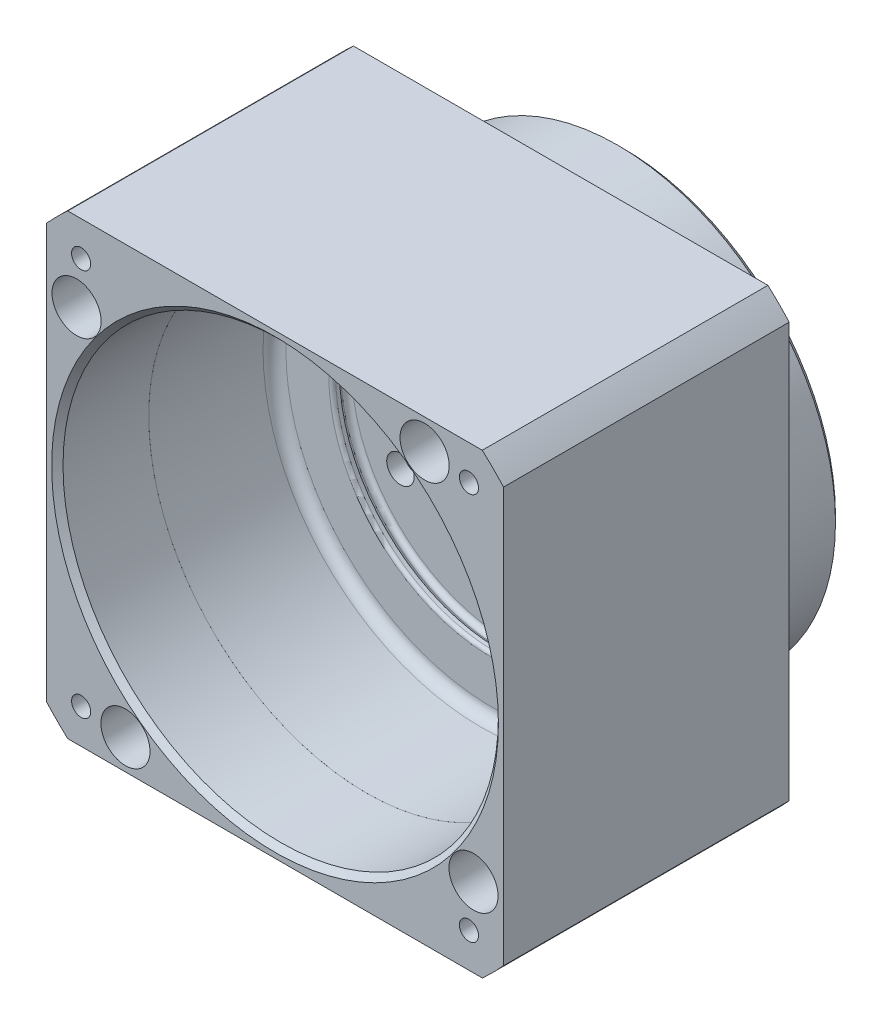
ISO-10303-21;
HEADER;
FILE_DESCRIPTION(('STEP AP214'),'2;1');
FILE_NAME('part.step','',(''),(''),'','','');
FILE_SCHEMA(('AUTOMOTIVE_DESIGN { 1 0 10303 214 1 1 1 1 }'));
ENDSEC;
DATA;
#1=APPLICATION_CONTEXT('core data for automotive mechanical design processes');
#2=APPLICATION_PROTOCOL_DEFINITION('international standard','automotive_design',2000,#1);
#3=PRODUCT_CONTEXT('',#1,'mechanical');
#4=PRODUCT('Part','Part','',(#3));
#5=PRODUCT_RELATED_PRODUCT_CATEGORY('part','',(#4));
#6=PRODUCT_DEFINITION_FORMATION('','',#4);
#7=PRODUCT_DEFINITION_CONTEXT('part definition',#1,'design');
#8=PRODUCT_DEFINITION('design','',#6,#7);
#9=PRODUCT_DEFINITION_SHAPE('','',#8);
#10=(LENGTH_UNIT() NAMED_UNIT(*) SI_UNIT(.MILLI.,.METRE.));
#11=(NAMED_UNIT(*) PLANE_ANGLE_UNIT() SI_UNIT($,.RADIAN.));
#12=(NAMED_UNIT(*) SI_UNIT($,.STERADIAN.) SOLID_ANGLE_UNIT());
#13=UNCERTAINTY_MEASURE_WITH_UNIT(LENGTH_MEASURE(1.E-05),#10,'distance_accuracy_value','');
#14=(GEOMETRIC_REPRESENTATION_CONTEXT(3) GLOBAL_UNCERTAINTY_ASSIGNED_CONTEXT((#13)) GLOBAL_UNIT_ASSIGNED_CONTEXT((#10,
#11,#12)) REPRESENTATION_CONTEXT('',''));
#15=CARTESIAN_POINT('',(0.,0.,0.));
#16=DIRECTION('',(0.,0.,1.));
#17=DIRECTION('',(1.,0.,0.));
#18=AXIS2_PLACEMENT_3D('',#15,#16,#17);
#19=CARTESIAN_POINT('',(0.,0.,-5.));
#20=DIRECTION('',(0.,0.,-1.));
#21=DIRECTION('',(1.,0.,0.));
#22=AXIS2_PLACEMENT_3D('',#19,#20,#21);
#23=TOROIDAL_SURFACE('',#22,15.5,0.5);
#24=CARTESIAN_POINT('',(0.,0.,-5.5));
#25=DIRECTION('',(0.,0.,-1.));
#26=DIRECTION('',(-1.,0.,0.));
#27=AXIS2_PLACEMENT_3D('',#24,#25,#26);
#28=CIRCLE('',#27,15.5);
#29=CARTESIAN_POINT('',(-15.5,0.,-5.5));
#30=VERTEX_POINT('',#29);
#31=EDGE_CURVE('E303',#30,#30,#28,.F.);
#32=ORIENTED_EDGE('',*,*,#31,.F.);
#33=EDGE_LOOP('',(#32));
#34=FACE_BOUND('',#33,.T.);
#35=CARTESIAN_POINT('',(0.,0.,-5.));
#36=DIRECTION('',(0.,0.,1.));
#37=DIRECTION('',(1.,0.,0.));
#38=AXIS2_PLACEMENT_3D('',#35,#36,#37);
#39=CIRCLE('',#38,15.);
#40=CARTESIAN_POINT('',(15.,0.,-5.));
#41=VERTEX_POINT('',#40);
#42=EDGE_CURVE('E295',#41,#41,#39,.T.);
#43=ORIENTED_EDGE('',*,*,#42,.T.);
#44=EDGE_LOOP('',(#43));
#45=FACE_BOUND('',#44,.T.);
#46=ADVANCED_FACE('F17',(#34,#45),#23,.T.);
#47=CARTESIAN_POINT('',(0.,0.,-5.5));
#48=DIRECTION('',(0.,0.,-1.));
#49=DIRECTION('',(-1.,0.,0.));
#50=AXIS2_PLACEMENT_3D('',#47,#48,#49);
#51=PLANE('',#50);
#52=CARTESIAN_POINT('',(0.,0.,-5.5));
#53=DIRECTION('',(0.,0.,1.));
#54=DIRECTION('',(1.,0.,0.));
#55=AXIS2_PLACEMENT_3D('',#52,#53,#54);
#56=CIRCLE('',#55,18.55);
#57=CARTESIAN_POINT('',(18.55,0.,-5.5));
#58=VERTEX_POINT('',#57);
#59=EDGE_CURVE('E22',#58,#58,#56,.T.);
#60=ORIENTED_EDGE('',*,*,#59,.F.);
#61=EDGE_LOOP('',(#60));
#62=FACE_BOUND('',#61,.T.);
#63=ORIENTED_EDGE('',*,*,#31,.T.);
#64=EDGE_LOOP('',(#63));
#65=FACE_BOUND('',#64,.T.);
#66=ADVANCED_FACE('F314',(#62,#65),#51,.T.);
#67=CARTESIAN_POINT('',(0.,0.,-5.5));
#68=DIRECTION('',(0.,0.,1.));
#69=DIRECTION('',(1.,0.,0.));
#70=AXIS2_PLACEMENT_3D('',#67,#68,#69);
#71=CYLINDRICAL_SURFACE('',#70,15.);
#72=ORIENTED_EDGE('',*,*,#42,.F.);
#73=EDGE_LOOP('',(#72));
#74=FACE_BOUND('',#73,.T.);
#75=CARTESIAN_POINT('',(0.,0.,0.600000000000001));
#76=DIRECTION('',(0.,0.,1.));
#77=DIRECTION('',(-1.,0.,0.));
#78=AXIS2_PLACEMENT_3D('',#75,#76,#77);
#79=CIRCLE('',#78,15.);
#80=CARTESIAN_POINT('',(-15.,0.,0.600000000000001));
#81=VERTEX_POINT('',#80);
#82=EDGE_CURVE('E257',#81,#81,#79,.T.);
#83=ORIENTED_EDGE('',*,*,#82,.T.);
#84=EDGE_LOOP('',(#83));
#85=FACE_BOUND('',#84,.T.);
#86=ADVANCED_FACE('F323',(#74,#85),#71,.F.);
#87=CARTESIAN_POINT('',(0.,0.,-4.99999999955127));
#88=DIRECTION('',(0.,0.,1.));
#89=DIRECTION('',(1.,0.,0.));
#90=AXIS2_PLACEMENT_3D('',#87,#88,#89);
#91=CONICAL_SURFACE('',#90,19.0499999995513,0.7853981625);
#92=ORIENTED_EDGE('',*,*,#59,.T.);
#93=EDGE_LOOP('',(#92));
#94=FACE_BOUND('',#93,.T.);
#95=CARTESIAN_POINT('',(0.,0.,-5.));
#96=DIRECTION('',(0.,0.,-1.));
#97=DIRECTION('',(-1.,0.,0.));
#98=AXIS2_PLACEMENT_3D('',#95,#96,#97);
#99=CIRCLE('',#98,19.05);
#100=CARTESIAN_POINT('',(-19.05,0.,-5.));
#101=VERTEX_POINT('',#100);
#102=EDGE_CURVE('E249',#101,#101,#99,.F.);
#103=ORIENTED_EDGE('',*,*,#102,.F.);
#104=EDGE_LOOP('',(#103));
#105=FACE_BOUND('',#104,.T.);
#106=ADVANCED_FACE('F326',(#94,#105),#91,.T.);
#107=CARTESIAN_POINT('',(0.,0.,0.600000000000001));
#108=DIRECTION('',(0.,0.,1.));
#109=DIRECTION('',(-1.,0.,0.));
#110=AXIS2_PLACEMENT_3D('',#107,#108,#109);
#111=TOROIDAL_SURFACE('',#110,14.6,0.4);
#112=ORIENTED_EDGE('',*,*,#82,.F.);
#113=EDGE_LOOP('',(#112));
#114=FACE_BOUND('',#113,.T.);
#115=CARTESIAN_POINT('',(0.,0.,1.));
#116=DIRECTION('',(0.,0.,1.));
#117=DIRECTION('',(1.,0.,0.));
#118=AXIS2_PLACEMENT_3D('',#115,#116,#117);
#119=CIRCLE('',#118,14.6);
#120=CARTESIAN_POINT('',(14.6,0.,1.));
#121=VERTEX_POINT('',#120);
#122=EDGE_CURVE('E223',#121,#121,#119,.T.);
#123=ORIENTED_EDGE('',*,*,#122,.T.);
#124=EDGE_LOOP('',(#123));
#125=FACE_BOUND('',#124,.T.);
#126=ADVANCED_FACE('F271',(#114,#125),#111,.F.);
#127=CARTESIAN_POINT('',(0.,0.,1.5));
#128=DIRECTION('',(0.,0.,1.));
#129=DIRECTION('',(-1.,0.,0.));
#130=AXIS2_PLACEMENT_3D('',#127,#128,#129);
#131=TOROIDAL_SURFACE('',#130,7.5,0.5);
#132=CARTESIAN_POINT('',(0.,0.,1.5));
#133=DIRECTION('',(0.,0.,-1.));
#134=DIRECTION('',(-1.,0.,0.));
#135=AXIS2_PLACEMENT_3D('',#132,#133,#134);
#136=CIRCLE('',#135,7.);
#137=CARTESIAN_POINT('',(-7.,0.,1.5));
#138=VERTEX_POINT('',#137);
#139=EDGE_CURVE('E212',#138,#138,#136,.F.);
#140=ORIENTED_EDGE('',*,*,#139,.T.);
#141=EDGE_LOOP('',(#140));
#142=FACE_BOUND('',#141,.T.);
#143=CARTESIAN_POINT('',(0.,0.,1.));
#144=DIRECTION('',(0.,0.,-1.));
#145=DIRECTION('',(1.,0.,0.));
#146=AXIS2_PLACEMENT_3D('',#143,#144,#145);
#147=CIRCLE('',#146,7.5);
#148=CARTESIAN_POINT('',(7.5,0.,1.));
#149=VERTEX_POINT('',#148);
#150=EDGE_CURVE('E596',#149,#149,#147,.T.);
#151=ORIENTED_EDGE('',*,*,#150,.T.);
#152=EDGE_LOOP('',(#151));
#153=FACE_BOUND('',#152,.T.);
#154=ADVANCED_FACE('F265',(#142,#153),#131,.T.);
#155=CARTESIAN_POINT('',(9.52627944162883,5.49999999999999,1.));
#156=DIRECTION('',(0.,0.,1.));
#157=DIRECTION('',(1.,0.,0.));
#158=AXIS2_PLACEMENT_3D('',#155,#156,#157);
#159=CYLINDRICAL_SURFACE('',#158,2.15);
#160=CARTESIAN_POINT('',(9.52627944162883,5.49999999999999,1.));
#161=DIRECTION('',(0.,0.,1.));
#162=DIRECTION('',(1.,0.,0.));
#163=AXIS2_PLACEMENT_3D('',#160,#161,#162);
#164=CIRCLE('',#163,2.15);
#165=CARTESIAN_POINT('',(11.6762794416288,5.49999999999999,1.));
#166=VERTEX_POINT('',#165);
#167=EDGE_CURVE('E594',#166,#166,#164,.F.);
#168=ORIENTED_EDGE('',*,*,#167,.T.);
#169=EDGE_LOOP('',(#168));
#170=FACE_BOUND('',#169,.T.);
#171=CARTESIAN_POINT('',(9.52627944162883,5.49999999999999,3.));
#172=DIRECTION('',(0.,0.,1.));
#173=DIRECTION('',(1.,0.,0.));
#174=AXIS2_PLACEMENT_3D('',#171,#172,#173);
#175=CIRCLE('',#174,2.15);
#176=CARTESIAN_POINT('',(11.6762794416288,5.49999999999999,3.));
#177=VERTEX_POINT('',#176);
#178=EDGE_CURVE('E215',#177,#177,#175,.T.);
#179=ORIENTED_EDGE('',*,*,#178,.T.);
#180=EDGE_LOOP('',(#179));
#181=FACE_BOUND('',#180,.T.);
#182=ADVANCED_FACE('F270',(#170,#181),#159,.F.);
#183=CARTESIAN_POINT('',(9.52627944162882,-5.50000000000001,1.));
#184=DIRECTION('',(0.,0.,1.));
#185=DIRECTION('',(1.,0.,0.));
#186=AXIS2_PLACEMENT_3D('',#183,#184,#185);
#187=CYLINDRICAL_SURFACE('',#186,2.15);
#188=CARTESIAN_POINT('',(9.52627944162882,-5.50000000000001,1.));
#189=DIRECTION('',(0.,0.,1.));
#190=DIRECTION('',(1.,0.,0.));
#191=AXIS2_PLACEMENT_3D('',#188,#189,#190);
#192=CIRCLE('',#191,2.15);
#193=CARTESIAN_POINT('',(11.6762794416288,-5.50000000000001,1.));
#194=VERTEX_POINT('',#193);
#195=EDGE_CURVE('E592',#194,#194,#192,.F.);
#196=ORIENTED_EDGE('',*,*,#195,.T.);
#197=EDGE_LOOP('',(#196));
#198=FACE_BOUND('',#197,.T.);
#199=CARTESIAN_POINT('',(9.52627944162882,-5.50000000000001,3.));
#200=DIRECTION('',(0.,0.,1.));
#201=DIRECTION('',(1.,0.,0.));
#202=AXIS2_PLACEMENT_3D('',#199,#200,#201);
#203=CIRCLE('',#202,2.15);
#204=CARTESIAN_POINT('',(11.6762794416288,-5.50000000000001,3.));
#205=VERTEX_POINT('',#204);
#206=EDGE_CURVE('E576',#205,#205,#203,.T.);
#207=ORIENTED_EDGE('',*,*,#206,.T.);
#208=EDGE_LOOP('',(#207));
#209=FACE_BOUND('',#208,.T.);
#210=ADVANCED_FACE('F883',(#198,#209),#187,.F.);
#211=CARTESIAN_POINT('',(0.,-11.,1.));
#212=DIRECTION('',(0.,0.,1.));
#213=DIRECTION('',(1.,0.,0.));
#214=AXIS2_PLACEMENT_3D('',#211,#212,#213);
#215=CYLINDRICAL_SURFACE('',#214,2.15);
#216=CARTESIAN_POINT('',(0.,-11.,1.));
#217=DIRECTION('',(0.,0.,1.));
#218=DIRECTION('',(1.,0.,0.));
#219=AXIS2_PLACEMENT_3D('',#216,#217,#218);
#220=CIRCLE('',#219,2.15);
#221=CARTESIAN_POINT('',(2.15,-11.,1.));
#222=VERTEX_POINT('',#221);
#223=EDGE_CURVE('E589',#222,#222,#220,.F.);
#224=ORIENTED_EDGE('',*,*,#223,.T.);
#225=EDGE_LOOP('',(#224));
#226=FACE_BOUND('',#225,.T.);
#227=CARTESIAN_POINT('',(0.,-11.,3.));
#228=DIRECTION('',(0.,0.,1.));
#229=DIRECTION('',(1.,0.,0.));
#230=AXIS2_PLACEMENT_3D('',#227,#228,#229);
#231=CIRCLE('',#230,2.15);
#232=CARTESIAN_POINT('',(2.15,-11.,3.));
#233=VERTEX_POINT('',#232);
#234=EDGE_CURVE('E573',#233,#233,#231,.T.);
#235=ORIENTED_EDGE('',*,*,#234,.T.);
#236=EDGE_LOOP('',(#235));
#237=FACE_BOUND('',#236,.T.);
#238=ADVANCED_FACE('F889',(#226,#237),#215,.F.);
#239=CARTESIAN_POINT('',(-9.52627944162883,-5.5,1.));
#240=DIRECTION('',(0.,0.,1.));
#241=DIRECTION('',(1.,0.,0.));
#242=AXIS2_PLACEMENT_3D('',#239,#240,#241);
#243=CYLINDRICAL_SURFACE('',#242,2.15);
#244=CARTESIAN_POINT('',(-9.52627944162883,-5.5,1.));
#245=DIRECTION('',(0.,0.,1.));
#246=DIRECTION('',(1.,0.,0.));
#247=AXIS2_PLACEMENT_3D('',#244,#245,#246);
#248=CIRCLE('',#247,2.15);
#249=CARTESIAN_POINT('',(-7.37627944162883,-5.5,1.));
#250=VERTEX_POINT('',#249);
#251=EDGE_CURVE('E586',#250,#250,#248,.F.);
#252=ORIENTED_EDGE('',*,*,#251,.T.);
#253=EDGE_LOOP('',(#252));
#254=FACE_BOUND('',#253,.T.);
#255=CARTESIAN_POINT('',(-9.52627944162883,-5.5,3.));
#256=DIRECTION('',(0.,0.,1.));
#257=DIRECTION('',(1.,0.,0.));
#258=AXIS2_PLACEMENT_3D('',#255,#256,#257);
#259=CIRCLE('',#258,2.15);
#260=CARTESIAN_POINT('',(-7.37627944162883,-5.5,3.));
#261=VERTEX_POINT('',#260);
#262=EDGE_CURVE('E570',#261,#261,#259,.T.);
#263=ORIENTED_EDGE('',*,*,#262,.T.);
#264=EDGE_LOOP('',(#263));
#265=FACE_BOUND('',#264,.T.);
#266=ADVANCED_FACE('F896',(#254,#265),#243,.F.);
#267=CARTESIAN_POINT('',(-9.52627944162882,5.5,1.));
#268=DIRECTION('',(0.,0.,1.));
#269=DIRECTION('',(1.,0.,0.));
#270=AXIS2_PLACEMENT_3D('',#267,#268,#269);
#271=CYLINDRICAL_SURFACE('',#270,2.15);
#272=CARTESIAN_POINT('',(-9.52627944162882,5.5,1.));
#273=DIRECTION('',(0.,0.,1.));
#274=DIRECTION('',(1.,0.,0.));
#275=AXIS2_PLACEMENT_3D('',#272,#273,#274);
#276=CIRCLE('',#275,2.15);
#277=CARTESIAN_POINT('',(-7.37627944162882,5.5,1.));
#278=VERTEX_POINT('',#277);
#279=EDGE_CURVE('E583',#278,#278,#276,.F.);
#280=ORIENTED_EDGE('',*,*,#279,.T.);
#281=EDGE_LOOP('',(#280));
#282=FACE_BOUND('',#281,.T.);
#283=CARTESIAN_POINT('',(-9.52627944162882,5.5,3.));
#284=DIRECTION('',(0.,0.,1.));
#285=DIRECTION('',(1.,0.,0.));
#286=AXIS2_PLACEMENT_3D('',#283,#284,#285);
#287=CIRCLE('',#286,2.15);
#288=CARTESIAN_POINT('',(-7.37627944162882,5.5,3.));
#289=VERTEX_POINT('',#288);
#290=EDGE_CURVE('E567',#289,#289,#287,.T.);
#291=ORIENTED_EDGE('',*,*,#290,.T.);
#292=EDGE_LOOP('',(#291));
#293=FACE_BOUND('',#292,.T.);
#294=ADVANCED_FACE('F904',(#282,#293),#271,.F.);
#295=CARTESIAN_POINT('',(0.,11.,1.));
#296=DIRECTION('',(0.,0.,1.));
#297=DIRECTION('',(1.,0.,0.));
#298=AXIS2_PLACEMENT_3D('',#295,#296,#297);
#299=CYLINDRICAL_SURFACE('',#298,2.15);
#300=CARTESIAN_POINT('',(0.,11.,1.));
#301=DIRECTION('',(0.,0.,1.));
#302=DIRECTION('',(1.,0.,0.));
#303=AXIS2_PLACEMENT_3D('',#300,#301,#302);
#304=CIRCLE('',#303,2.15);
#305=CARTESIAN_POINT('',(2.15,11.,1.));
#306=VERTEX_POINT('',#305);
#307=EDGE_CURVE('E216',#306,#306,#304,.F.);
#308=ORIENTED_EDGE('',*,*,#307,.T.);
#309=EDGE_LOOP('',(#308));
#310=FACE_BOUND('',#309,.T.);
#311=CARTESIAN_POINT('',(0.,11.,3.));
#312=DIRECTION('',(0.,0.,1.));
#313=DIRECTION('',(1.,0.,0.));
#314=AXIS2_PLACEMENT_3D('',#311,#312,#313);
#315=CIRCLE('',#314,2.15);
#316=CARTESIAN_POINT('',(2.15,11.,3.));
#317=VERTEX_POINT('',#316);
#318=EDGE_CURVE('E209',#317,#317,#315,.T.);
#319=ORIENTED_EDGE('',*,*,#318,.T.);
#320=EDGE_LOOP('',(#319));
#321=FACE_BOUND('',#320,.T.);
#322=ADVANCED_FACE('F912',(#310,#321),#299,.F.);
#323=CARTESIAN_POINT('',(0.,0.,0.));
#324=DIRECTION('',(0.,0.,-1.));
#325=DIRECTION('',(-1.,0.,0.));
#326=AXIS2_PLACEMENT_3D('',#323,#324,#325);
#327=CYLINDRICAL_SURFACE('',#326,19.05);
#328=ORIENTED_EDGE('',*,*,#102,.T.);
#329=EDGE_LOOP('',(#328));
#330=FACE_BOUND('',#329,.T.);
#331=CARTESIAN_POINT('',(0.,0.,-0.853589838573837));
#332=DIRECTION('',(0.,0.,-1.));
#333=DIRECTION('',(1.,0.,0.));
#334=AXIS2_PLACEMENT_3D('',#331,#332,#333);
#335=CIRCLE('',#334,19.0499999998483);
#336=CARTESIAN_POINT('',(19.0499999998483,0.,-0.853589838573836));
#337=VERTEX_POINT('',#336);
#338=EDGE_CURVE('E200',#337,#337,#335,.F.);
#339=ORIENTED_EDGE('',*,*,#338,.F.);
#340=EDGE_LOOP('',(#339));
#341=FACE_BOUND('',#340,.T.);
#342=ADVANCED_FACE('F241',(#330,#341),#327,.T.);
#343=CARTESIAN_POINT('',(0.,0.,1.));
#344=DIRECTION('',(0.,0.,1.));
#345=DIRECTION('',(1.,0.,0.));
#346=AXIS2_PLACEMENT_3D('',#343,#344,#345);
#347=PLANE('',#346);
#348=ORIENTED_EDGE('',*,*,#307,.F.);
#349=EDGE_LOOP('',(#348));
#350=FACE_BOUND('',#349,.T.);
#351=ORIENTED_EDGE('',*,*,#279,.F.);
#352=EDGE_LOOP('',(#351));
#353=FACE_BOUND('',#352,.T.);
#354=ORIENTED_EDGE('',*,*,#251,.F.);
#355=EDGE_LOOP('',(#354));
#356=FACE_BOUND('',#355,.T.);
#357=ORIENTED_EDGE('',*,*,#223,.F.);
#358=EDGE_LOOP('',(#357));
#359=FACE_BOUND('',#358,.T.);
#360=ORIENTED_EDGE('',*,*,#195,.F.);
#361=EDGE_LOOP('',(#360));
#362=FACE_BOUND('',#361,.T.);
#363=ORIENTED_EDGE('',*,*,#167,.F.);
#364=EDGE_LOOP('',(#363));
#365=FACE_BOUND('',#364,.T.);
#366=ORIENTED_EDGE('',*,*,#150,.F.);
#367=EDGE_LOOP('',(#366));
#368=FACE_BOUND('',#367,.T.);
#369=CARTESIAN_POINT('',(-5.5,9.52627944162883,1.));
#370=DIRECTION('',(0.,0.,-1.));
#371=DIRECTION('',(-1.,0.,0.));
#372=AXIS2_PLACEMENT_3D('',#369,#370,#371);
#373=CIRCLE('',#372,2.5);
#374=CARTESIAN_POINT('',(-8.,9.52627944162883,1.));
#375=VERTEX_POINT('',#374);
#376=EDGE_CURVE('E208',#375,#375,#373,.F.);
#377=ORIENTED_EDGE('',*,*,#376,.T.);
#378=EDGE_LOOP('',(#377));
#379=FACE_BOUND('',#378,.T.);
#380=ORIENTED_EDGE('',*,*,#122,.F.);
#381=EDGE_LOOP('',(#380));
#382=FACE_BOUND('',#381,.T.);
#383=ADVANCED_FACE('F230',(#350,#353,#356,#359,#362,#365,#368,#379,#382),#347,.F.);
#384=CARTESIAN_POINT('',(0.,0.,6.));
#385=DIRECTION('',(0.,0.,-1.));
#386=DIRECTION('',(-1.,0.,0.));
#387=AXIS2_PLACEMENT_3D('',#384,#385,#386);
#388=CYLINDRICAL_SURFACE('',#387,7.);
#389=ORIENTED_EDGE('',*,*,#139,.F.);
#390=EDGE_LOOP('',(#389));
#391=FACE_BOUND('',#390,.T.);
#392=CARTESIAN_POINT('',(0.,0.,4.));
#393=DIRECTION('',(0.,0.,-1.));
#394=DIRECTION('',(1.,0.,0.));
#395=AXIS2_PLACEMENT_3D('',#392,#393,#394);
#396=CIRCLE('',#395,7.);
#397=CARTESIAN_POINT('',(7.,0.,4.));
#398=VERTEX_POINT('',#397);
#399=EDGE_CURVE('E181',#398,#398,#396,.T.);
#400=ORIENTED_EDGE('',*,*,#399,.F.);
#401=EDGE_LOOP('',(#400));
#402=FACE_BOUND('',#401,.T.);
#403=ADVANCED_FACE('F240',(#391,#402),#388,.F.);
#404=CARTESIAN_POINT('',(9.52627944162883,5.49999999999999,3.));
#405=DIRECTION('',(0.,0.,1.));
#406=DIRECTION('',(1.,0.,0.));
#407=AXIS2_PLACEMENT_3D('',#404,#405,#406);
#408=PLANE('',#407);
#409=ORIENTED_EDGE('',*,*,#178,.F.);
#410=EDGE_LOOP('',(#409));
#411=FACE_BOUND('',#410,.T.);
#412=CARTESIAN_POINT('',(9.52627944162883,5.49999999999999,2.9999999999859));
#413=DIRECTION('',(0.,0.,1.));
#414=DIRECTION('',(1.,0.,0.));
#415=AXIS2_PLACEMENT_3D('',#412,#413,#414);
#416=CIRCLE('',#415,1.2);
#417=CARTESIAN_POINT('',(10.7262794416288,5.49999999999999,2.9999999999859));
#418=VERTEX_POINT('',#417);
#419=EDGE_CURVE('E560',#418,#418,#416,.T.);
#420=ORIENTED_EDGE('',*,*,#419,.T.);
#421=EDGE_LOOP('',(#420));
#422=FACE_BOUND('',#421,.T.);
#423=ADVANCED_FACE('F936',(#411,#422),#408,.F.);
#424=CARTESIAN_POINT('',(9.52627944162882,-5.50000000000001,3.));
#425=DIRECTION('',(0.,0.,1.));
#426=DIRECTION('',(1.,0.,0.));
#427=AXIS2_PLACEMENT_3D('',#424,#425,#426);
#428=PLANE('',#427);
#429=ORIENTED_EDGE('',*,*,#206,.F.);
#430=EDGE_LOOP('',(#429));
#431=FACE_BOUND('',#430,.T.);
#432=CARTESIAN_POINT('',(9.52627944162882,-5.50000000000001,2.9999999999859));
#433=DIRECTION('',(0.,0.,1.));
#434=DIRECTION('',(1.,0.,0.));
#435=AXIS2_PLACEMENT_3D('',#432,#433,#434);
#436=CIRCLE('',#435,1.2);
#437=CARTESIAN_POINT('',(10.7262794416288,-5.50000000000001,2.9999999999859));
#438=VERTEX_POINT('',#437);
#439=EDGE_CURVE('E557',#438,#438,#436,.T.);
#440=ORIENTED_EDGE('',*,*,#439,.T.);
#441=EDGE_LOOP('',(#440));
#442=FACE_BOUND('',#441,.T.);
#443=ADVANCED_FACE('F943',(#431,#442),#428,.F.);
#444=CARTESIAN_POINT('',(0.,-11.,3.));
#445=DIRECTION('',(0.,0.,1.));
#446=DIRECTION('',(1.,0.,0.));
#447=AXIS2_PLACEMENT_3D('',#444,#445,#446);
#448=PLANE('',#447);
#449=ORIENTED_EDGE('',*,*,#234,.F.);
#450=EDGE_LOOP('',(#449));
#451=FACE_BOUND('',#450,.T.);
#452=CARTESIAN_POINT('',(0.,-11.,2.9999999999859));
#453=DIRECTION('',(0.,0.,1.));
#454=DIRECTION('',(1.,0.,0.));
#455=AXIS2_PLACEMENT_3D('',#452,#453,#454);
#456=CIRCLE('',#455,1.2);
#457=CARTESIAN_POINT('',(1.2,-11.,2.9999999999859));
#458=VERTEX_POINT('',#457);
#459=EDGE_CURVE('E554',#458,#458,#456,.T.);
#460=ORIENTED_EDGE('',*,*,#459,.T.);
#461=EDGE_LOOP('',(#460));
#462=FACE_BOUND('',#461,.T.);
#463=ADVANCED_FACE('F950',(#451,#462),#448,.F.);
#464=CARTESIAN_POINT('',(-9.52627944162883,-5.5,3.));
#465=DIRECTION('',(0.,0.,1.));
#466=DIRECTION('',(1.,0.,0.));
#467=AXIS2_PLACEMENT_3D('',#464,#465,#466);
#468=PLANE('',#467);
#469=ORIENTED_EDGE('',*,*,#262,.F.);
#470=EDGE_LOOP('',(#469));
#471=FACE_BOUND('',#470,.T.);
#472=CARTESIAN_POINT('',(-9.52627944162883,-5.5,2.9999999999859));
#473=DIRECTION('',(0.,0.,1.));
#474=DIRECTION('',(1.,0.,0.));
#475=AXIS2_PLACEMENT_3D('',#472,#473,#474);
#476=CIRCLE('',#475,1.2);
#477=CARTESIAN_POINT('',(-8.32627944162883,-5.5,2.9999999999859));
#478=VERTEX_POINT('',#477);
#479=EDGE_CURVE('E551',#478,#478,#476,.T.);
#480=ORIENTED_EDGE('',*,*,#479,.T.);
#481=EDGE_LOOP('',(#480));
#482=FACE_BOUND('',#481,.T.);
#483=ADVANCED_FACE('F958',(#471,#482),#468,.F.);
#484=CARTESIAN_POINT('',(-9.52627944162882,5.5,3.));
#485=DIRECTION('',(0.,0.,1.));
#486=DIRECTION('',(1.,0.,0.));
#487=AXIS2_PLACEMENT_3D('',#484,#485,#486);
#488=PLANE('',#487);
#489=ORIENTED_EDGE('',*,*,#290,.F.);
#490=EDGE_LOOP('',(#489));
#491=FACE_BOUND('',#490,.T.);
#492=CARTESIAN_POINT('',(-9.52627944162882,5.5,2.9999999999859));
#493=DIRECTION('',(0.,0.,1.));
#494=DIRECTION('',(1.,0.,0.));
#495=AXIS2_PLACEMENT_3D('',#492,#493,#494);
#496=CIRCLE('',#495,1.2);
#497=CARTESIAN_POINT('',(-8.32627944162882,5.5,2.9999999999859));
#498=VERTEX_POINT('',#497);
#499=EDGE_CURVE('E548',#498,#498,#496,.T.);
#500=ORIENTED_EDGE('',*,*,#499,.T.);
#501=EDGE_LOOP('',(#500));
#502=FACE_BOUND('',#501,.T.);
#503=ADVANCED_FACE('F966',(#491,#502),#488,.F.);
#504=CARTESIAN_POINT('',(0.,11.,3.));
#505=DIRECTION('',(0.,0.,1.));
#506=DIRECTION('',(1.,0.,0.));
#507=AXIS2_PLACEMENT_3D('',#504,#505,#506);
#508=PLANE('',#507);
#509=ORIENTED_EDGE('',*,*,#318,.F.);
#510=EDGE_LOOP('',(#509));
#511=FACE_BOUND('',#510,.T.);
#512=CARTESIAN_POINT('',(0.,11.,2.9999999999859));
#513=DIRECTION('',(0.,0.,1.));
#514=DIRECTION('',(1.,0.,0.));
#515=AXIS2_PLACEMENT_3D('',#512,#513,#514);
#516=CIRCLE('',#515,1.2);
#517=CARTESIAN_POINT('',(1.2,11.,2.9999999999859));
#518=VERTEX_POINT('',#517);
#519=EDGE_CURVE('E545',#518,#518,#516,.T.);
#520=ORIENTED_EDGE('',*,*,#519,.T.);
#521=EDGE_LOOP('',(#520));
#522=FACE_BOUND('',#521,.T.);
#523=ADVANCED_FACE('F974',(#511,#522),#508,.F.);
#524=CARTESIAN_POINT('',(0.,0.,-0.853589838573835));
#525=DIRECTION('',(0.,0.,-1.));
#526=DIRECTION('',(0.,1.,0.));
#527=AXIS2_PLACEMENT_3D('',#524,#525,#526);
#528=CONICAL_SURFACE('',#527,19.0499999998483,0.523598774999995);
#529=CARTESIAN_POINT('',(0.,0.,-0.599999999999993));
#530=DIRECTION('',(0.,0.,-1.));
#531=DIRECTION('',(1.,0.,0.));
#532=AXIS2_PLACEMENT_3D('',#529,#530,#531);
#533=CIRCLE('',#532,18.9035898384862);
#534=CARTESIAN_POINT('',(18.9035898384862,0.,-0.599999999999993));
#535=VERTEX_POINT('',#534);
#536=EDGE_CURVE('E156',#535,#535,#533,.T.);
#537=ORIENTED_EDGE('',*,*,#536,.T.);
#538=EDGE_LOOP('',(#537));
#539=FACE_BOUND('',#538,.T.);
#540=ORIENTED_EDGE('',*,*,#338,.T.);
#541=EDGE_LOOP('',(#540));
#542=FACE_BOUND('',#541,.T.);
#543=ADVANCED_FACE('F606',(#539,#542),#528,.T.);
#544=CARTESIAN_POINT('',(-5.5,9.52627944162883,4.5));
#545=DIRECTION('',(0.,0.,-1.));
#546=DIRECTION('',(-1.,0.,0.));
#547=AXIS2_PLACEMENT_3D('',#544,#545,#546);
#548=CYLINDRICAL_SURFACE('',#547,2.5);
#549=ORIENTED_EDGE('',*,*,#376,.F.);
#550=EDGE_LOOP('',(#549));
#551=FACE_BOUND('',#550,.T.);
#552=CARTESIAN_POINT('',(-5.5,9.52627944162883,4.5));
#553=DIRECTION('',(0.,0.,-1.));
#554=DIRECTION('',(-1.,0.,0.));
#555=AXIS2_PLACEMENT_3D('',#552,#553,#554);
#556=CIRCLE('',#555,2.5);
#557=CARTESIAN_POINT('',(-8.,9.52627944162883,4.5));
#558=VERTEX_POINT('',#557);
#559=EDGE_CURVE('E542',#558,#558,#556,.F.);
#560=ORIENTED_EDGE('',*,*,#559,.T.);
#561=EDGE_LOOP('',(#560));
#562=FACE_BOUND('',#561,.T.);
#563=ADVANCED_FACE('F190',(#551,#562),#548,.F.);
#564=CARTESIAN_POINT('',(0.,0.,4.));
#565=DIRECTION('',(0.,0.,-1.));
#566=DIRECTION('',(1.,0.,0.));
#567=AXIS2_PLACEMENT_3D('',#564,#565,#566);
#568=TOROIDAL_SURFACE('',#567,7.5,0.5);
#569=ORIENTED_EDGE('',*,*,#399,.T.);
#570=EDGE_LOOP('',(#569));
#571=FACE_BOUND('',#570,.T.);
#572=CARTESIAN_POINT('',(0.,0.,4.5));
#573=DIRECTION('',(0.,0.,1.));
#574=DIRECTION('',(-1.,0.,0.));
#575=AXIS2_PLACEMENT_3D('',#572,#573,#574);
#576=CIRCLE('',#575,7.5);
#577=CARTESIAN_POINT('',(-7.5,0.,4.5));
#578=VERTEX_POINT('',#577);
#579=EDGE_CURVE('E541',#578,#578,#576,.T.);
#580=ORIENTED_EDGE('',*,*,#579,.T.);
#581=EDGE_LOOP('',(#580));
#582=FACE_BOUND('',#581,.T.);
#583=ADVANCED_FACE('F184',(#571,#582),#568,.T.);
#584=CARTESIAN_POINT('',(9.52627944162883,5.49999999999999,494999.499923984));
#585=DIRECTION('',(0.,0.,1.));
#586=DIRECTION('',(1.,0.,0.));
#587=AXIS2_PLACEMENT_3D('',#584,#585,#586);
#588=CYLINDRICAL_SURFACE('',#587,1.2);
#589=CARTESIAN_POINT('',(9.52627944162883,5.49999999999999,4.50000000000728));
#590=DIRECTION('',(0.,0.,1.));
#591=DIRECTION('',(1.,0.,0.));
#592=AXIS2_PLACEMENT_3D('',#589,#590,#591);
#593=CIRCLE('',#592,1.2);
#594=CARTESIAN_POINT('',(10.7262794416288,5.49999999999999,4.50000000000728));
#595=VERTEX_POINT('',#594);
#596=EDGE_CURVE('E538',#595,#595,#593,.T.);
#597=ORIENTED_EDGE('',*,*,#596,.T.);
#598=EDGE_LOOP('',(#597));
#599=FACE_BOUND('',#598,.T.);
#600=ORIENTED_EDGE('',*,*,#419,.F.);
#601=EDGE_LOOP('',(#600));
#602=FACE_BOUND('',#601,.T.);
#603=ADVANCED_FACE('F189',(#599,#602),#588,.F.);
#604=CARTESIAN_POINT('',(9.52627944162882,-5.50000000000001,494999.499923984));
#605=DIRECTION('',(0.,0.,1.));
#606=DIRECTION('',(1.,0.,0.));
#607=AXIS2_PLACEMENT_3D('',#604,#605,#606);
#608=CYLINDRICAL_SURFACE('',#607,1.2);
#609=CARTESIAN_POINT('',(9.52627944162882,-5.50000000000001,4.50000000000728));
#610=DIRECTION('',(0.,0.,1.));
#611=DIRECTION('',(1.,0.,0.));
#612=AXIS2_PLACEMENT_3D('',#609,#610,#611);
#613=CIRCLE('',#612,1.2);
#614=CARTESIAN_POINT('',(10.7262794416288,-5.50000000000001,4.50000000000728));
#615=VERTEX_POINT('',#614);
#616=EDGE_CURVE('E535',#615,#615,#613,.T.);
#617=ORIENTED_EDGE('',*,*,#616,.T.);
#618=EDGE_LOOP('',(#617));
#619=FACE_BOUND('',#618,.T.);
#620=ORIENTED_EDGE('',*,*,#439,.F.);
#621=EDGE_LOOP('',(#620));
#622=FACE_BOUND('',#621,.T.);
#623=ADVANCED_FACE('F1003',(#619,#622),#608,.F.);
#624=CARTESIAN_POINT('',(0.,-11.,494999.499923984));
#625=DIRECTION('',(0.,0.,1.));
#626=DIRECTION('',(1.,0.,0.));
#627=AXIS2_PLACEMENT_3D('',#624,#625,#626);
#628=CYLINDRICAL_SURFACE('',#627,1.2);
#629=CARTESIAN_POINT('',(0.,-11.,4.50000000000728));
#630=DIRECTION('',(0.,0.,1.));
#631=DIRECTION('',(1.,0.,0.));
#632=AXIS2_PLACEMENT_3D('',#629,#630,#631);
#633=CIRCLE('',#632,1.2);
#634=CARTESIAN_POINT('',(1.2,-11.,4.50000000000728));
#635=VERTEX_POINT('',#634);
#636=EDGE_CURVE('E532',#635,#635,#633,.T.);
#637=ORIENTED_EDGE('',*,*,#636,.T.);
#638=EDGE_LOOP('',(#637));
#639=FACE_BOUND('',#638,.T.);
#640=ORIENTED_EDGE('',*,*,#459,.F.);
#641=EDGE_LOOP('',(#640));
#642=FACE_BOUND('',#641,.T.);
#643=ADVANCED_FACE('F1010',(#639,#642),#628,.F.);
#644=CARTESIAN_POINT('',(-9.52627944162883,-5.5,494999.499923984));
#645=DIRECTION('',(0.,0.,1.));
#646=DIRECTION('',(1.,0.,0.));
#647=AXIS2_PLACEMENT_3D('',#644,#645,#646);
#648=CYLINDRICAL_SURFACE('',#647,1.2);
#649=CARTESIAN_POINT('',(-9.52627944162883,-5.5,4.50000000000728));
#650=DIRECTION('',(0.,0.,1.));
#651=DIRECTION('',(1.,0.,0.));
#652=AXIS2_PLACEMENT_3D('',#649,#650,#651);
#653=CIRCLE('',#652,1.2);
#654=CARTESIAN_POINT('',(-8.32627944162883,-5.5,4.50000000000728));
#655=VERTEX_POINT('',#654);
#656=EDGE_CURVE('E529',#655,#655,#653,.T.);
#657=ORIENTED_EDGE('',*,*,#656,.T.);
#658=EDGE_LOOP('',(#657));
#659=FACE_BOUND('',#658,.T.);
#660=ORIENTED_EDGE('',*,*,#479,.F.);
#661=EDGE_LOOP('',(#660));
#662=FACE_BOUND('',#661,.T.);
#663=ADVANCED_FACE('F1017',(#659,#662),#648,.F.);
#664=CARTESIAN_POINT('',(-9.52627944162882,5.5,494999.499923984));
#665=DIRECTION('',(0.,0.,1.));
#666=DIRECTION('',(1.,0.,0.));
#667=AXIS2_PLACEMENT_3D('',#664,#665,#666);
#668=CYLINDRICAL_SURFACE('',#667,1.2);
#669=CARTESIAN_POINT('',(-9.52627944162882,5.5,4.50000000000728));
#670=DIRECTION('',(0.,0.,1.));
#671=DIRECTION('',(1.,0.,0.));
#672=AXIS2_PLACEMENT_3D('',#669,#670,#671);
#673=CIRCLE('',#672,1.2);
#674=CARTESIAN_POINT('',(-8.32627944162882,5.5,4.50000000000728));
#675=VERTEX_POINT('',#674);
#676=EDGE_CURVE('E526',#675,#675,#673,.T.);
#677=ORIENTED_EDGE('',*,*,#676,.T.);
#678=EDGE_LOOP('',(#677));
#679=FACE_BOUND('',#678,.T.);
#680=ORIENTED_EDGE('',*,*,#499,.F.);
#681=EDGE_LOOP('',(#680));
#682=FACE_BOUND('',#681,.T.);
#683=ADVANCED_FACE('F1025',(#679,#682),#668,.F.);
#684=CARTESIAN_POINT('',(0.,11.,494999.499923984));
#685=DIRECTION('',(0.,0.,1.));
#686=DIRECTION('',(1.,0.,0.));
#687=AXIS2_PLACEMENT_3D('',#684,#685,#686);
#688=CYLINDRICAL_SURFACE('',#687,1.2);
#689=ORIENTED_EDGE('',*,*,#519,.F.);
#690=EDGE_LOOP('',(#689));
#691=FACE_BOUND('',#690,.T.);
#692=CARTESIAN_POINT('',(0.,11.,4.50000000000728));
#693=DIRECTION('',(0.,0.,1.));
#694=DIRECTION('',(1.,0.,0.));
#695=AXIS2_PLACEMENT_3D('',#692,#693,#694);
#696=CIRCLE('',#695,1.2);
#697=CARTESIAN_POINT('',(1.2,11.,4.50000000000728));
#698=VERTEX_POINT('',#697);
#699=EDGE_CURVE('E523',#698,#698,#696,.T.);
#700=ORIENTED_EDGE('',*,*,#699,.T.);
#701=EDGE_LOOP('',(#700));
#702=FACE_BOUND('',#701,.T.);
#703=ADVANCED_FACE('F1033',(#691,#702),#688,.F.);
#704=CARTESIAN_POINT('',(17.3703223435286,-13.089476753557,-494997.99957576));
#705=DIRECTION('',(0.,0.,-1.));
#706=DIRECTION('',(-1.,0.,0.));
#707=AXIS2_PLACEMENT_3D('',#704,#705,#706);
#708=CYLINDRICAL_SURFACE('',#707,1.2);
#709=CARTESIAN_POINT('',(17.3703223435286,-13.089476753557,2.20000000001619));
#710=DIRECTION('',(0.,0.,-1.));
#711=DIRECTION('',(-1.,0.,0.));
#712=AXIS2_PLACEMENT_3D('',#709,#710,#711);
#713=CIRCLE('',#712,1.2);
#714=CARTESIAN_POINT('',(16.1703223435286,-13.089476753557,2.20000000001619));
#715=VERTEX_POINT('',#714);
#716=EDGE_CURVE('E520',#715,#715,#713,.F.);
#717=ORIENTED_EDGE('',*,*,#716,.T.);
#718=EDGE_LOOP('',(#717));
#719=FACE_BOUND('',#718,.T.);
#720=CARTESIAN_POINT('',(17.3703223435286,-13.089476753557,0.));
#721=DIRECTION('',(0.,0.,-1.));
#722=DIRECTION('',(-1.,0.,0.));
#723=AXIS2_PLACEMENT_3D('',#720,#721,#722);
#724=CIRCLE('',#723,1.2);
#725=CARTESIAN_POINT('',(16.1703223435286,-13.089476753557,0.));
#726=VERTEX_POINT('',#725);
#727=EDGE_CURVE('E508',#726,#726,#724,.F.);
#728=ORIENTED_EDGE('',*,*,#727,.F.);
#729=EDGE_LOOP('',(#728));
#730=FACE_BOUND('',#729,.T.);
#731=ADVANCED_FACE('F1041',(#719,#730),#708,.F.);
#732=CARTESIAN_POINT('',(-13.089476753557,-17.3703223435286,-494997.99957576));
#733=DIRECTION('',(0.,0.,-1.));
#734=DIRECTION('',(-1.,0.,0.));
#735=AXIS2_PLACEMENT_3D('',#732,#733,#734);
#736=CYLINDRICAL_SURFACE('',#735,1.2);
#737=CARTESIAN_POINT('',(-13.089476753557,-17.3703223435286,2.20000000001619));
#738=DIRECTION('',(0.,0.,-1.));
#739=DIRECTION('',(-1.,0.,0.));
#740=AXIS2_PLACEMENT_3D('',#737,#738,#739);
#741=CIRCLE('',#740,1.2);
#742=CARTESIAN_POINT('',(-14.289476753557,-17.3703223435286,2.20000000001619));
#743=VERTEX_POINT('',#742);
#744=EDGE_CURVE('E517',#743,#743,#741,.F.);
#745=ORIENTED_EDGE('',*,*,#744,.T.);
#746=EDGE_LOOP('',(#745));
#747=FACE_BOUND('',#746,.T.);
#748=CARTESIAN_POINT('',(-13.089476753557,-17.3703223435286,0.));
#749=DIRECTION('',(0.,0.,-1.));
#750=DIRECTION('',(-1.,0.,0.));
#751=AXIS2_PLACEMENT_3D('',#748,#749,#750);
#752=CIRCLE('',#751,1.2);
#753=CARTESIAN_POINT('',(-14.289476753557,-17.3703223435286,0.));
#754=VERTEX_POINT('',#753);
#755=EDGE_CURVE('E505',#754,#754,#752,.F.);
#756=ORIENTED_EDGE('',*,*,#755,.F.);
#757=EDGE_LOOP('',(#756));
#758=FACE_BOUND('',#757,.T.);
#759=ADVANCED_FACE('F1049',(#747,#758),#736,.F.);
#760=CARTESIAN_POINT('',(-17.3703223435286,13.089476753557,-494997.99957576));
#761=DIRECTION('',(0.,0.,-1.));
#762=DIRECTION('',(-1.,0.,0.));
#763=AXIS2_PLACEMENT_3D('',#760,#761,#762);
#764=CYLINDRICAL_SURFACE('',#763,1.2);
#765=CARTESIAN_POINT('',(-17.3703223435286,13.089476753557,2.20000000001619));
#766=DIRECTION('',(0.,0.,-1.));
#767=DIRECTION('',(-1.,0.,0.));
#768=AXIS2_PLACEMENT_3D('',#765,#766,#767);
#769=CIRCLE('',#768,1.2);
#770=CARTESIAN_POINT('',(-18.5703223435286,13.089476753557,2.20000000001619));
#771=VERTEX_POINT('',#770);
#772=EDGE_CURVE('E514',#771,#771,#769,.F.);
#773=ORIENTED_EDGE('',*,*,#772,.T.);
#774=EDGE_LOOP('',(#773));
#775=FACE_BOUND('',#774,.T.);
#776=CARTESIAN_POINT('',(-17.3703223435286,13.089476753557,0.));
#777=DIRECTION('',(0.,0.,-1.));
#778=DIRECTION('',(-1.,0.,0.));
#779=AXIS2_PLACEMENT_3D('',#776,#777,#778);
#780=CIRCLE('',#779,1.2);
#781=CARTESIAN_POINT('',(-18.5703223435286,13.089476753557,0.));
#782=VERTEX_POINT('',#781);
#783=EDGE_CURVE('E502',#782,#782,#780,.F.);
#784=ORIENTED_EDGE('',*,*,#783,.F.);
#785=EDGE_LOOP('',(#784));
#786=FACE_BOUND('',#785,.T.);
#787=ADVANCED_FACE('F1057',(#775,#786),#764,.F.);
#788=CARTESIAN_POINT('',(13.089476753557,17.3703223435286,-494997.99957576));
#789=DIRECTION('',(0.,0.,-1.));
#790=DIRECTION('',(-1.,0.,0.));
#791=AXIS2_PLACEMENT_3D('',#788,#789,#790);
#792=CYLINDRICAL_SURFACE('',#791,1.2);
#793=CARTESIAN_POINT('',(13.089476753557,17.3703223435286,2.20000000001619));
#794=DIRECTION('',(0.,0.,-1.));
#795=DIRECTION('',(-1.,0.,0.));
#796=AXIS2_PLACEMENT_3D('',#793,#794,#795);
#797=CIRCLE('',#796,1.2);
#798=CARTESIAN_POINT('',(11.889476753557,17.3703223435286,2.20000000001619));
#799=VERTEX_POINT('',#798);
#800=EDGE_CURVE('E511',#799,#799,#797,.F.);
#801=ORIENTED_EDGE('',*,*,#800,.T.);
#802=EDGE_LOOP('',(#801));
#803=FACE_BOUND('',#802,.T.);
#804=CARTESIAN_POINT('',(13.089476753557,17.3703223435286,0.));
#805=DIRECTION('',(0.,0.,-1.));
#806=DIRECTION('',(-1.,0.,0.));
#807=AXIS2_PLACEMENT_3D('',#804,#805,#806);
#808=CIRCLE('',#807,1.2);
#809=CARTESIAN_POINT('',(11.889476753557,17.3703223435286,0.));
#810=VERTEX_POINT('',#809);
#811=EDGE_CURVE('E499',#810,#810,#808,.F.);
#812=ORIENTED_EDGE('',*,*,#811,.F.);
#813=EDGE_LOOP('',(#812));
#814=FACE_BOUND('',#813,.T.);
#815=ADVANCED_FACE('F164',(#803,#814),#792,.F.);
#816=CARTESIAN_POINT('',(0.,0.,-0.400000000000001));
#817=DIRECTION('',(0.,0.,-1.));
#818=DIRECTION('',(1.,0.,0.));
#819=AXIS2_PLACEMENT_3D('',#816,#817,#818);
#820=TOROIDAL_SURFACE('',#819,19.25,0.400000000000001);
#821=CARTESIAN_POINT('',(0.,0.,0.));
#822=DIRECTION('',(0.,0.,-1.));
#823=DIRECTION('',(-1.,0.,0.));
#824=AXIS2_PLACEMENT_3D('',#821,#822,#823);
#825=CIRCLE('',#824,19.25);
#826=CARTESIAN_POINT('',(-19.25,0.,0.));
#827=VERTEX_POINT('',#826);
#828=EDGE_CURVE('E120',#827,#827,#825,.F.);
#829=ORIENTED_EDGE('',*,*,#828,.F.);
#830=EDGE_LOOP('',(#829));
#831=FACE_BOUND('',#830,.T.);
#832=ORIENTED_EDGE('',*,*,#536,.F.);
#833=EDGE_LOOP('',(#832));
#834=FACE_BOUND('',#833,.T.);
#835=ADVANCED_FACE('F159',(#831,#834),#820,.F.);
#836=CARTESIAN_POINT('',(0.,0.,4.5));
#837=DIRECTION('',(0.,0.,-1.));
#838=DIRECTION('',(-1.,0.,0.));
#839=AXIS2_PLACEMENT_3D('',#836,#837,#838);
#840=PLANE('',#839);
#841=CARTESIAN_POINT('',(0.,0.,4.5));
#842=DIRECTION('',(0.,0.,-1.));
#843=DIRECTION('',(-1.,0.,0.));
#844=AXIS2_PLACEMENT_3D('',#841,#842,#843);
#845=CIRCLE('',#844,13.8);
#846=CARTESIAN_POINT('',(-13.8,0.,4.5));
#847=VERTEX_POINT('',#846);
#848=EDGE_CURVE('E114',#847,#847,#845,.F.);
#849=ORIENTED_EDGE('',*,*,#848,.T.);
#850=EDGE_LOOP('',(#849));
#851=FACE_BOUND('',#850,.T.);
#852=ORIENTED_EDGE('',*,*,#699,.F.);
#853=EDGE_LOOP('',(#852));
#854=FACE_BOUND('',#853,.T.);
#855=ORIENTED_EDGE('',*,*,#676,.F.);
#856=EDGE_LOOP('',(#855));
#857=FACE_BOUND('',#856,.T.);
#858=ORIENTED_EDGE('',*,*,#656,.F.);
#859=EDGE_LOOP('',(#858));
#860=FACE_BOUND('',#859,.T.);
#861=ORIENTED_EDGE('',*,*,#636,.F.);
#862=EDGE_LOOP('',(#861));
#863=FACE_BOUND('',#862,.T.);
#864=ORIENTED_EDGE('',*,*,#616,.F.);
#865=EDGE_LOOP('',(#864));
#866=FACE_BOUND('',#865,.T.);
#867=ORIENTED_EDGE('',*,*,#596,.F.);
#868=EDGE_LOOP('',(#867));
#869=FACE_BOUND('',#868,.T.);
#870=ORIENTED_EDGE('',*,*,#579,.F.);
#871=EDGE_LOOP('',(#870));
#872=FACE_BOUND('',#871,.T.);
#873=ORIENTED_EDGE('',*,*,#559,.F.);
#874=EDGE_LOOP('',(#873));
#875=FACE_BOUND('',#874,.T.);
#876=ADVANCED_FACE('F107',(#851,#854,#857,#860,#863,#866,#869,#872,#875),#840,.F.);
#877=CARTESIAN_POINT('',(16.9705627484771,-16.9705627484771,17.9999999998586));
#878=DIRECTION('',(0.,0.,1.));
#879=DIRECTION('',(1.,0.,0.));
#880=AXIS2_PLACEMENT_3D('',#877,#878,#879);
#881=CONICAL_SURFACE('',#880,0.837599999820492,1.02974425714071);
#882=CARTESIAN_POINT('',(16.9705627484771,-16.9705627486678,17.4967191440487));
#883=VERTEX_POINT('',#882);
#884=VERTEX_LOOP('',#883);
#885=FACE_BOUND('',#884,.T.);
#886=CARTESIAN_POINT('',(16.9705627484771,-16.9705627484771,18.));
#887=DIRECTION('',(0.,0.,-1.));
#888=DIRECTION('',(-1.,0.,0.));
#889=AXIS2_PLACEMENT_3D('',#886,#887,#888);
#890=CIRCLE('',#889,0.8376);
#891=CARTESIAN_POINT('',(16.1329627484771,-16.9705627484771,18.));
#892=VERTEX_POINT('',#891);
#893=EDGE_CURVE('E111',#892,#892,#890,.F.);
#894=ORIENTED_EDGE('',*,*,#893,.T.);
#895=EDGE_LOOP('',(#894));
#896=FACE_BOUND('',#895,.T.);
#897=ADVANCED_FACE('F103',(#885,#896),#881,.F.);
#898=CARTESIAN_POINT('',(-16.9705627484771,-16.9705627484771,17.9999999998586));
#899=DIRECTION('',(0.,0.,1.));
#900=DIRECTION('',(1.,0.,0.));
#901=AXIS2_PLACEMENT_3D('',#898,#899,#900);
#902=CONICAL_SURFACE('',#901,0.837599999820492,1.02974425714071);
#903=CARTESIAN_POINT('',(-16.9705627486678,-16.9705627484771,17.4967191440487));
#904=VERTEX_POINT('',#903);
#905=VERTEX_LOOP('',#904);
#906=FACE_BOUND('',#905,.T.);
#907=CARTESIAN_POINT('',(-16.9705627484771,-16.9705627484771,18.));
#908=DIRECTION('',(0.,0.,-1.));
#909=DIRECTION('',(-1.,0.,0.));
#910=AXIS2_PLACEMENT_3D('',#907,#908,#909);
#911=CIRCLE('',#910,0.8376);
#912=CARTESIAN_POINT('',(-17.8081627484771,-16.9705627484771,18.));
#913=VERTEX_POINT('',#912);
#914=EDGE_CURVE('E113',#913,#913,#911,.F.);
#915=ORIENTED_EDGE('',*,*,#914,.T.);
#916=EDGE_LOOP('',(#915));
#917=FACE_BOUND('',#916,.T.);
#918=ADVANCED_FACE('F106',(#906,#917),#902,.F.);
#919=CARTESIAN_POINT('',(-16.9705627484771,16.9705627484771,17.9999999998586));
#920=DIRECTION('',(0.,0.,1.));
#921=DIRECTION('',(1.,0.,0.));
#922=AXIS2_PLACEMENT_3D('',#919,#920,#921);
#923=CONICAL_SURFACE('',#922,0.837599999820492,1.02974425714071);
#924=CARTESIAN_POINT('',(-16.9705627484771,16.9705627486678,17.4967191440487));
#925=VERTEX_POINT('',#924);
#926=VERTEX_LOOP('',#925);
#927=FACE_BOUND('',#926,.T.);
#928=CARTESIAN_POINT('',(-16.9705627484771,16.9705627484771,18.));
#929=DIRECTION('',(0.,0.,-1.));
#930=DIRECTION('',(-1.,0.,0.));
#931=AXIS2_PLACEMENT_3D('',#928,#929,#930);
#932=CIRCLE('',#931,0.8376);
#933=CARTESIAN_POINT('',(-17.8081627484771,16.9705627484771,18.));
#934=VERTEX_POINT('',#933);
#935=EDGE_CURVE('E117',#934,#934,#932,.F.);
#936=ORIENTED_EDGE('',*,*,#935,.T.);
#937=EDGE_LOOP('',(#936));
#938=FACE_BOUND('',#937,.T.);
#939=ADVANCED_FACE('F753',(#927,#938),#923,.F.);
#940=CARTESIAN_POINT('',(17.3703223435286,-13.089476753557,2.2));
#941=DIRECTION('',(0.,0.,-1.));
#942=DIRECTION('',(-1.,0.,0.));
#943=AXIS2_PLACEMENT_3D('',#940,#941,#942);
#944=PLANE('',#943);
#945=CARTESIAN_POINT('',(17.3703223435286,-13.089476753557,2.2));
#946=DIRECTION('',(0.,0.,-1.));
#947=DIRECTION('',(-1.,0.,0.));
#948=AXIS2_PLACEMENT_3D('',#945,#946,#947);
#949=CIRCLE('',#948,2.15);
#950=CARTESIAN_POINT('',(15.2203223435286,-13.089476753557,2.2));
#951=VERTEX_POINT('',#950);
#952=EDGE_CURVE('E485',#951,#951,#949,.F.);
#953=ORIENTED_EDGE('',*,*,#952,.T.);
#954=EDGE_LOOP('',(#953));
#955=FACE_BOUND('',#954,.T.);
#956=ORIENTED_EDGE('',*,*,#716,.F.);
#957=EDGE_LOOP('',(#956));
#958=FACE_BOUND('',#957,.T.);
#959=ADVANCED_FACE('F758',(#955,#958),#944,.F.);
#960=CARTESIAN_POINT('',(-13.089476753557,-17.3703223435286,2.2));
#961=DIRECTION('',(0.,0.,-1.));
#962=DIRECTION('',(-1.,0.,0.));
#963=AXIS2_PLACEMENT_3D('',#960,#961,#962);
#964=PLANE('',#963);
#965=CARTESIAN_POINT('',(-13.089476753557,-17.3703223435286,2.2));
#966=DIRECTION('',(0.,0.,-1.));
#967=DIRECTION('',(-1.,0.,0.));
#968=AXIS2_PLACEMENT_3D('',#965,#966,#967);
#969=CIRCLE('',#968,2.15);
#970=CARTESIAN_POINT('',(-15.239476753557,-17.3703223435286,2.2));
#971=VERTEX_POINT('',#970);
#972=EDGE_CURVE('E490',#971,#971,#969,.F.);
#973=ORIENTED_EDGE('',*,*,#972,.T.);
#974=EDGE_LOOP('',(#973));
#975=FACE_BOUND('',#974,.T.);
#976=ORIENTED_EDGE('',*,*,#744,.F.);
#977=EDGE_LOOP('',(#976));
#978=FACE_BOUND('',#977,.T.);
#979=ADVANCED_FACE('F764',(#975,#978),#964,.F.);
#980=CARTESIAN_POINT('',(-17.3703223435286,13.089476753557,2.2));
#981=DIRECTION('',(0.,0.,-1.));
#982=DIRECTION('',(-1.,0.,0.));
#983=AXIS2_PLACEMENT_3D('',#980,#981,#982);
#984=PLANE('',#983);
#985=CARTESIAN_POINT('',(-17.3703223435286,13.089476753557,2.2));
#986=DIRECTION('',(0.,0.,-1.));
#987=DIRECTION('',(-1.,0.,0.));
#988=AXIS2_PLACEMENT_3D('',#985,#986,#987);
#989=CIRCLE('',#988,2.15);
#990=CARTESIAN_POINT('',(-19.5203223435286,13.089476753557,2.2));
#991=VERTEX_POINT('',#990);
#992=EDGE_CURVE('E495',#991,#991,#989,.F.);
#993=ORIENTED_EDGE('',*,*,#992,.T.);
#994=EDGE_LOOP('',(#993));
#995=FACE_BOUND('',#994,.T.);
#996=ORIENTED_EDGE('',*,*,#772,.F.);
#997=EDGE_LOOP('',(#996));
#998=FACE_BOUND('',#997,.T.);
#999=ADVANCED_FACE('F714',(#995,#998),#984,.F.);
#1000=CARTESIAN_POINT('',(13.089476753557,17.3703223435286,2.2));
#1001=DIRECTION('',(0.,0.,-1.));
#1002=DIRECTION('',(-1.,0.,0.));
#1003=AXIS2_PLACEMENT_3D('',#1000,#1001,#1002);
#1004=PLANE('',#1003);
#1005=CARTESIAN_POINT('',(13.089476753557,17.3703223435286,2.2));
#1006=DIRECTION('',(0.,0.,-1.));
#1007=DIRECTION('',(-1.,0.,0.));
#1008=AXIS2_PLACEMENT_3D('',#1005,#1006,#1007);
#1009=CIRCLE('',#1008,2.15);
#1010=CARTESIAN_POINT('',(10.939476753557,17.3703223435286,2.2));
#1011=VERTEX_POINT('',#1010);
#1012=EDGE_CURVE('E480',#1011,#1011,#1009,.F.);
#1013=ORIENTED_EDGE('',*,*,#1012,.T.);
#1014=EDGE_LOOP('',(#1013));
#1015=FACE_BOUND('',#1014,.T.);
#1016=ORIENTED_EDGE('',*,*,#800,.F.);
#1017=EDGE_LOOP('',(#1016));
#1018=FACE_BOUND('',#1017,.T.);
#1019=ADVANCED_FACE('F770',(#1015,#1018),#1004,.F.);
#1020=CARTESIAN_POINT('',(16.9705627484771,16.9705627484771,17.9999999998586));
#1021=DIRECTION('',(0.,0.,1.));
#1022=DIRECTION('',(1.,0.,0.));
#1023=AXIS2_PLACEMENT_3D('',#1020,#1021,#1022);
#1024=CONICAL_SURFACE('',#1023,0.837599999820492,1.02974425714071);
#1025=CARTESIAN_POINT('',(16.9705627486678,16.9705627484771,17.4967191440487));
#1026=VERTEX_POINT('',#1025);
#1027=VERTEX_LOOP('',#1026);
#1028=FACE_BOUND('',#1027,.T.);
#1029=CARTESIAN_POINT('',(16.9705627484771,16.9705627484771,18.));
#1030=DIRECTION('',(0.,0.,-1.));
#1031=DIRECTION('',(-1.,0.,0.));
#1032=AXIS2_PLACEMENT_3D('',#1029,#1030,#1031);
#1033=CIRCLE('',#1032,0.8376);
#1034=CARTESIAN_POINT('',(16.1329627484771,16.9705627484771,18.));
#1035=VERTEX_POINT('',#1034);
#1036=EDGE_CURVE('E477',#1035,#1035,#1033,.F.);
#1037=ORIENTED_EDGE('',*,*,#1036,.T.);
#1038=EDGE_LOOP('',(#1037));
#1039=FACE_BOUND('',#1038,.T.);
#1040=ADVANCED_FACE('F772',(#1028,#1039),#1024,.F.);
#1041=CARTESIAN_POINT('',(0.,0.,0.));
#1042=DIRECTION('',(0.,0.,-1.));
#1043=DIRECTION('',(-1.,0.,0.));
#1044=AXIS2_PLACEMENT_3D('',#1041,#1042,#1043);
#1045=PLANE('',#1044);
#1046=ORIENTED_EDGE('',*,*,#828,.T.);
#1047=EDGE_LOOP('',(#1046));
#1048=FACE_BOUND('',#1047,.T.);
#1049=CARTESIAN_POINT('',(0.,0.,0.));
#1050=DIRECTION('',(0.,0.,-1.));
#1051=DIRECTION('',(-1.,0.,0.));
#1052=AXIS2_PLACEMENT_3D('',#1049,#1050,#1051);
#1053=CIRCLE('',#1052,27.);
#1054=CARTESIAN_POINT('',(18.1383571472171,-20.,0.));
#1055=VERTEX_POINT('',#1054);
#1056=CARTESIAN_POINT('',(20.,-18.1383571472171,0.));
#1057=VERTEX_POINT('',#1056);
#1058=EDGE_CURVE('E465',#1055,#1057,#1053,.F.);
#1059=ORIENTED_EDGE('',*,*,#1058,.F.);
#1060=DIRECTION('',(1.,0.,0.));
#1061=VECTOR('',#1060,1.);
#1062=CARTESIAN_POINT('',(0.,-20.,0.));
#1063=LINE('',#1062,#1061);
#1064=CARTESIAN_POINT('',(-18.1383571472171,-20.,0.));
#1065=VERTEX_POINT('',#1064);
#1066=EDGE_CURVE('E462',#1065,#1055,#1063,.T.);
#1067=ORIENTED_EDGE('',*,*,#1066,.F.);
#1068=CARTESIAN_POINT('',(0.,0.,0.));
#1069=DIRECTION('',(0.,0.,-1.));
#1070=DIRECTION('',(-1.,0.,0.));
#1071=AXIS2_PLACEMENT_3D('',#1068,#1069,#1070);
#1072=CIRCLE('',#1071,27.);
#1073=CARTESIAN_POINT('',(-20.,-18.1383571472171,0.));
#1074=VERTEX_POINT('',#1073);
#1075=EDGE_CURVE('E457',#1074,#1065,#1072,.F.);
#1076=ORIENTED_EDGE('',*,*,#1075,.F.);
#1077=DIRECTION('',(0.,1.,0.));
#1078=VECTOR('',#1077,1.);
#1079=CARTESIAN_POINT('',(-20.,18.1383571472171,0.));
#1080=LINE('',#1079,#1078);
#1081=CARTESIAN_POINT('',(-20.,18.1383571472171,0.));
#1082=VERTEX_POINT('',#1081);
#1083=EDGE_CURVE('E128',#1074,#1082,#1080,.T.);
#1084=ORIENTED_EDGE('',*,*,#1083,.T.);
#1085=CARTESIAN_POINT('',(0.,0.,0.));
#1086=DIRECTION('',(0.,0.,-1.));
#1087=DIRECTION('',(-1.,0.,0.));
#1088=AXIS2_PLACEMENT_3D('',#1085,#1086,#1087);
#1089=CIRCLE('',#1088,27.);
#1090=CARTESIAN_POINT('',(-18.1383571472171,20.,0.));
#1091=VERTEX_POINT('',#1090);
#1092=EDGE_CURVE('E90',#1091,#1082,#1089,.F.);
#1093=ORIENTED_EDGE('',*,*,#1092,.F.);
#1094=DIRECTION('',(1.,0.,0.));
#1095=VECTOR('',#1094,1.);
#1096=CARTESIAN_POINT('',(0.,20.,0.));
#1097=LINE('',#1096,#1095);
#1098=CARTESIAN_POINT('',(18.1383571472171,20.,0.));
#1099=VERTEX_POINT('',#1098);
#1100=EDGE_CURVE('E84',#1099,#1091,#1097,.F.);
#1101=ORIENTED_EDGE('',*,*,#1100,.F.);
#1102=CARTESIAN_POINT('',(0.,0.,0.));
#1103=DIRECTION('',(0.,0.,-1.));
#1104=DIRECTION('',(-1.,0.,0.));
#1105=AXIS2_PLACEMENT_3D('',#1102,#1103,#1104);
#1106=CIRCLE('',#1105,27.);
#1107=CARTESIAN_POINT('',(20.,18.1383571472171,0.));
#1108=VERTEX_POINT('',#1107);
#1109=EDGE_CURVE('E472',#1108,#1099,#1106,.F.);
#1110=ORIENTED_EDGE('',*,*,#1109,.F.);
#1111=DIRECTION('',(0.,1.,0.));
#1112=VECTOR('',#1111,1.);
#1113=CARTESIAN_POINT('',(20.,-18.1383571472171,0.));
#1114=LINE('',#1113,#1112);
#1115=EDGE_CURVE('E469',#1108,#1057,#1114,.F.);
#1116=ORIENTED_EDGE('',*,*,#1115,.T.);
#1117=EDGE_LOOP('',(#1059,#1067,#1076,#1084,#1093,#1101,#1110,#1116));
#1118=FACE_BOUND('',#1117,.T.);
#1119=ORIENTED_EDGE('',*,*,#811,.T.);
#1120=EDGE_LOOP('',(#1119));
#1121=FACE_BOUND('',#1120,.T.);
#1122=ORIENTED_EDGE('',*,*,#783,.T.);
#1123=EDGE_LOOP('',(#1122));
#1124=FACE_BOUND('',#1123,.T.);
#1125=ORIENTED_EDGE('',*,*,#755,.T.);
#1126=EDGE_LOOP('',(#1125));
#1127=FACE_BOUND('',#1126,.T.);
#1128=ORIENTED_EDGE('',*,*,#727,.T.);
#1129=EDGE_LOOP('',(#1128));
#1130=FACE_BOUND('',#1129,.T.);
#1131=ADVANCED_FACE('F137',(#1048,#1118,#1121,#1124,#1127,#1130),#1045,.T.);
#1132=CARTESIAN_POINT('',(0.,0.,4.90000000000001));
#1133=DIRECTION('',(0.,0.,-1.));
#1134=DIRECTION('',(1.,0.,0.));
#1135=AXIS2_PLACEMENT_3D('',#1132,#1133,#1134);
#1136=TOROIDAL_SURFACE('',#1135,13.8,0.400000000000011);
#1137=ORIENTED_EDGE('',*,*,#848,.F.);
#1138=EDGE_LOOP('',(#1137));
#1139=FACE_BOUND('',#1138,.T.);
#1140=CARTESIAN_POINT('',(0.,0.,5.1));
#1141=DIRECTION('',(0.,0.,-1.));
#1142=DIRECTION('',(1.,0.,0.));
#1143=AXIS2_PLACEMENT_3D('',#1140,#1141,#1142);
#1144=CIRCLE('',#1143,14.1464101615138);
#1145=CARTESIAN_POINT('',(14.1464101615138,0.,5.1));
#1146=VERTEX_POINT('',#1145);
#1147=EDGE_CURVE('E449',#1146,#1146,#1144,.F.);
#1148=ORIENTED_EDGE('',*,*,#1147,.T.);
#1149=EDGE_LOOP('',(#1148));
#1150=FACE_BOUND('',#1149,.T.);
#1151=ADVANCED_FACE('F131',(#1139,#1150),#1136,.F.);
#1152=CARTESIAN_POINT('',(16.9705627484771,-16.9705627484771,25.));
#1153=DIRECTION('',(0.,0.,-1.));
#1154=DIRECTION('',(-1.,0.,0.));
#1155=AXIS2_PLACEMENT_3D('',#1152,#1153,#1154);
#1156=CYLINDRICAL_SURFACE('',#1155,0.8376);
#1157=CARTESIAN_POINT('',(16.9705627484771,-16.9705627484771,25.));
#1158=DIRECTION('',(0.,0.,-1.));
#1159=DIRECTION('',(-1.,0.,0.));
#1160=AXIS2_PLACEMENT_3D('',#1157,#1158,#1159);
#1161=CIRCLE('',#1160,0.8376);
#1162=CARTESIAN_POINT('',(16.1329627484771,-16.9705627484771,25.));
#1163=VERTEX_POINT('',#1162);
#1164=EDGE_CURVE('E452',#1163,#1163,#1161,.F.);
#1165=ORIENTED_EDGE('',*,*,#1164,.T.);
#1166=EDGE_LOOP('',(#1165));
#1167=FACE_BOUND('',#1166,.T.);
#1168=ORIENTED_EDGE('',*,*,#893,.F.);
#1169=EDGE_LOOP('',(#1168));
#1170=FACE_BOUND('',#1169,.T.);
#1171=ADVANCED_FACE('F136',(#1167,#1170),#1156,.F.);
#1172=CARTESIAN_POINT('',(-16.9705627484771,-16.9705627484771,25.));
#1173=DIRECTION('',(0.,0.,-1.));
#1174=DIRECTION('',(-1.,0.,0.));
#1175=AXIS2_PLACEMENT_3D('',#1172,#1173,#1174);
#1176=CYLINDRICAL_SURFACE('',#1175,0.8376);
#1177=CARTESIAN_POINT('',(-16.9705627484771,-16.9705627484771,25.));
#1178=DIRECTION('',(0.,0.,-1.));
#1179=DIRECTION('',(-1.,0.,0.));
#1180=AXIS2_PLACEMENT_3D('',#1177,#1178,#1179);
#1181=CIRCLE('',#1180,0.8376);
#1182=CARTESIAN_POINT('',(-17.8081627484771,-16.9705627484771,25.));
#1183=VERTEX_POINT('',#1182);
#1184=EDGE_CURVE('E702',#1183,#1183,#1181,.F.);
#1185=ORIENTED_EDGE('',*,*,#1184,.T.);
#1186=EDGE_LOOP('',(#1185));
#1187=FACE_BOUND('',#1186,.T.);
#1188=ORIENTED_EDGE('',*,*,#914,.F.);
#1189=EDGE_LOOP('',(#1188));
#1190=FACE_BOUND('',#1189,.T.);
#1191=ADVANCED_FACE('F740',(#1187,#1190),#1176,.F.);
#1192=CARTESIAN_POINT('',(-16.9705627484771,16.9705627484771,25.));
#1193=DIRECTION('',(0.,0.,-1.));
#1194=DIRECTION('',(-1.,0.,0.));
#1195=AXIS2_PLACEMENT_3D('',#1192,#1193,#1194);
#1196=CYLINDRICAL_SURFACE('',#1195,0.8376);
#1197=CARTESIAN_POINT('',(-16.9705627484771,16.9705627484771,25.));
#1198=DIRECTION('',(0.,0.,-1.));
#1199=DIRECTION('',(-1.,0.,0.));
#1200=AXIS2_PLACEMENT_3D('',#1197,#1198,#1199);
#1201=CIRCLE('',#1200,0.8376);
#1202=CARTESIAN_POINT('',(-17.8081627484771,16.9705627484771,25.));
#1203=VERTEX_POINT('',#1202);
#1204=EDGE_CURVE('E699',#1203,#1203,#1201,.F.);
#1205=ORIENTED_EDGE('',*,*,#1204,.T.);
#1206=EDGE_LOOP('',(#1205));
#1207=FACE_BOUND('',#1206,.T.);
#1208=ORIENTED_EDGE('',*,*,#935,.F.);
#1209=EDGE_LOOP('',(#1208));
#1210=FACE_BOUND('',#1209,.T.);
#1211=ADVANCED_FACE('F737',(#1207,#1210),#1196,.F.);
#1212=CARTESIAN_POINT('',(17.3703223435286,-13.089476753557,25.));
#1213=DIRECTION('',(0.,0.,-1.));
#1214=DIRECTION('',(-1.,0.,0.));
#1215=AXIS2_PLACEMENT_3D('',#1212,#1213,#1214);
#1216=CYLINDRICAL_SURFACE('',#1215,2.15);
#1217=CARTESIAN_POINT('',(17.3703223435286,-13.089476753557,25.));
#1218=DIRECTION('',(0.,0.,-1.));
#1219=DIRECTION('',(-1.,0.,0.));
#1220=AXIS2_PLACEMENT_3D('',#1217,#1218,#1219);
#1221=CIRCLE('',#1220,2.15);
#1222=CARTESIAN_POINT('',(15.2203223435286,-13.089476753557,25.));
#1223=VERTEX_POINT('',#1222);
#1224=EDGE_CURVE('E696',#1223,#1223,#1221,.F.);
#1225=ORIENTED_EDGE('',*,*,#1224,.T.);
#1226=EDGE_LOOP('',(#1225));
#1227=FACE_BOUND('',#1226,.T.);
#1228=ORIENTED_EDGE('',*,*,#952,.F.);
#1229=EDGE_LOOP('',(#1228));
#1230=FACE_BOUND('',#1229,.T.);
#1231=ADVANCED_FACE('F730',(#1227,#1230),#1216,.F.);
#1232=CARTESIAN_POINT('',(-13.089476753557,-17.3703223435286,25.));
#1233=DIRECTION('',(0.,0.,-1.));
#1234=DIRECTION('',(-1.,0.,0.));
#1235=AXIS2_PLACEMENT_3D('',#1232,#1233,#1234);
#1236=CYLINDRICAL_SURFACE('',#1235,2.15);
#1237=CARTESIAN_POINT('',(-13.089476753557,-17.3703223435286,25.));
#1238=DIRECTION('',(0.,0.,-1.));
#1239=DIRECTION('',(-1.,0.,0.));
#1240=AXIS2_PLACEMENT_3D('',#1237,#1238,#1239);
#1241=CIRCLE('',#1240,2.15);
#1242=CARTESIAN_POINT('',(-15.239476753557,-17.3703223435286,25.));
#1243=VERTEX_POINT('',#1242);
#1244=EDGE_CURVE('E693',#1243,#1243,#1241,.F.);
#1245=ORIENTED_EDGE('',*,*,#1244,.T.);
#1246=EDGE_LOOP('',(#1245));
#1247=FACE_BOUND('',#1246,.T.);
#1248=ORIENTED_EDGE('',*,*,#972,.F.);
#1249=EDGE_LOOP('',(#1248));
#1250=FACE_BOUND('',#1249,.T.);
#1251=ADVANCED_FACE('F720',(#1247,#1250),#1236,.F.);
#1252=CARTESIAN_POINT('',(-17.3703223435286,13.089476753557,25.));
#1253=DIRECTION('',(0.,0.,-1.));
#1254=DIRECTION('',(-1.,0.,0.));
#1255=AXIS2_PLACEMENT_3D('',#1252,#1253,#1254);
#1256=CYLINDRICAL_SURFACE('',#1255,2.15);
#1257=CARTESIAN_POINT('',(-17.3703223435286,13.089476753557,25.));
#1258=DIRECTION('',(0.,0.,-1.));
#1259=DIRECTION('',(-1.,0.,0.));
#1260=AXIS2_PLACEMENT_3D('',#1257,#1258,#1259);
#1261=CIRCLE('',#1260,2.15);
#1262=CARTESIAN_POINT('',(-19.5203223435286,13.089476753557,25.));
#1263=VERTEX_POINT('',#1262);
#1264=EDGE_CURVE('E690',#1263,#1263,#1261,.F.);
#1265=ORIENTED_EDGE('',*,*,#1264,.T.);
#1266=EDGE_LOOP('',(#1265));
#1267=FACE_BOUND('',#1266,.T.);
#1268=ORIENTED_EDGE('',*,*,#992,.F.);
#1269=EDGE_LOOP('',(#1268));
#1270=FACE_BOUND('',#1269,.T.);
#1271=ADVANCED_FACE('F717',(#1267,#1270),#1256,.F.);
#1272=CARTESIAN_POINT('',(13.089476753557,17.3703223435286,25.));
#1273=DIRECTION('',(0.,0.,-1.));
#1274=DIRECTION('',(-1.,0.,0.));
#1275=AXIS2_PLACEMENT_3D('',#1272,#1273,#1274);
#1276=CYLINDRICAL_SURFACE('',#1275,2.15);
#1277=CARTESIAN_POINT('',(13.089476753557,17.3703223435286,25.));
#1278=DIRECTION('',(0.,0.,-1.));
#1279=DIRECTION('',(-1.,0.,0.));
#1280=AXIS2_PLACEMENT_3D('',#1277,#1278,#1279);
#1281=CIRCLE('',#1280,2.15);
#1282=CARTESIAN_POINT('',(10.939476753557,17.3703223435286,25.));
#1283=VERTEX_POINT('',#1282);
#1284=EDGE_CURVE('E687',#1283,#1283,#1281,.F.);
#1285=ORIENTED_EDGE('',*,*,#1284,.T.);
#1286=EDGE_LOOP('',(#1285));
#1287=FACE_BOUND('',#1286,.T.);
#1288=ORIENTED_EDGE('',*,*,#1012,.F.);
#1289=EDGE_LOOP('',(#1288));
#1290=FACE_BOUND('',#1289,.T.);
#1291=ADVANCED_FACE('F719',(#1287,#1290),#1276,.F.);
#1292=CARTESIAN_POINT('',(16.9705627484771,16.9705627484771,25.));
#1293=DIRECTION('',(0.,0.,-1.));
#1294=DIRECTION('',(-1.,0.,0.));
#1295=AXIS2_PLACEMENT_3D('',#1292,#1293,#1294);
#1296=CYLINDRICAL_SURFACE('',#1295,0.8376);
#1297=CARTESIAN_POINT('',(16.9705627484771,16.9705627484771,25.));
#1298=DIRECTION('',(0.,0.,-1.));
#1299=DIRECTION('',(-1.,0.,0.));
#1300=AXIS2_PLACEMENT_3D('',#1297,#1298,#1299);
#1301=CIRCLE('',#1300,0.8376);
#1302=CARTESIAN_POINT('',(16.1329627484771,16.9705627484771,25.));
#1303=VERTEX_POINT('',#1302);
#1304=EDGE_CURVE('E448',#1303,#1303,#1301,.F.);
#1305=ORIENTED_EDGE('',*,*,#1304,.T.);
#1306=EDGE_LOOP('',(#1305));
#1307=FACE_BOUND('',#1306,.T.);
#1308=ORIENTED_EDGE('',*,*,#1036,.F.);
#1309=EDGE_LOOP('',(#1308));
#1310=FACE_BOUND('',#1309,.T.);
#1311=ADVANCED_FACE('F727',(#1307,#1310),#1296,.F.);
#1312=CARTESIAN_POINT('',(-20.,18.1383571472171,25.));
#1313=DIRECTION('',(1.,0.,0.));
#1314=DIRECTION('',(0.,0.,-1.));
#1315=AXIS2_PLACEMENT_3D('',#1312,#1313,#1314);
#1316=PLANE('',#1315);
#1317=DIRECTION('',(0.,0.,-1.));
#1318=VECTOR('',#1317,1.);
#1319=CARTESIAN_POINT('',(-20.,-18.1383571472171,25.));
#1320=LINE('',#1319,#1318);
#1321=CARTESIAN_POINT('',(-20.,-18.1383571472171,25.));
#1322=VERTEX_POINT('',#1321);
#1323=EDGE_CURVE('E453',#1322,#1074,#1320,.T.);
#1324=ORIENTED_EDGE('',*,*,#1323,.F.);
#1325=DIRECTION('',(0.,1.,0.));
#1326=VECTOR('',#1325,1.);
#1327=CARTESIAN_POINT('',(-20.,0.,25.));
#1328=LINE('',#1327,#1326);
#1329=CARTESIAN_POINT('',(-20.,18.1383571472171,25.));
#1330=VERTEX_POINT('',#1329);
#1331=EDGE_CURVE('E445',#1322,#1330,#1328,.T.);
#1332=ORIENTED_EDGE('',*,*,#1331,.T.);
#1333=DIRECTION('',(0.,0.,-1.));
#1334=VECTOR('',#1333,1.);
#1335=CARTESIAN_POINT('',(-20.,18.1383571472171,25.));
#1336=LINE('',#1335,#1334);
#1337=EDGE_CURVE('E475',#1082,#1330,#1336,.F.);
#1338=ORIENTED_EDGE('',*,*,#1337,.F.);
#1339=ORIENTED_EDGE('',*,*,#1083,.F.);
#1340=EDGE_LOOP('',(#1324,#1332,#1338,#1339));
#1341=FACE_BOUND('',#1340,.T.);
#1342=ADVANCED_FACE('F782',(#1341),#1316,.F.);
#1343=CARTESIAN_POINT('',(0.,0.,25.));
#1344=DIRECTION('',(0.,0.,-1.));
#1345=DIRECTION('',(-1.,0.,0.));
#1346=AXIS2_PLACEMENT_3D('',#1343,#1344,#1345);
#1347=CYLINDRICAL_SURFACE('',#1346,27.);
#1348=CARTESIAN_POINT('',(0.,0.,25.));
#1349=DIRECTION('',(0.,0.,-1.));
#1350=DIRECTION('',(-1.,0.,0.));
#1351=AXIS2_PLACEMENT_3D('',#1348,#1349,#1350);
#1352=CIRCLE('',#1351,27.);
#1353=CARTESIAN_POINT('',(-18.1383571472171,20.,25.));
#1354=VERTEX_POINT('',#1353);
#1355=EDGE_CURVE('E444',#1330,#1354,#1352,.T.);
#1356=ORIENTED_EDGE('',*,*,#1355,.T.);
#1357=DIRECTION('',(0.,0.,1.));
#1358=VECTOR('',#1357,1.);
#1359=CARTESIAN_POINT('',(-18.1383571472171,20.,25.));
#1360=LINE('',#1359,#1358);
#1361=EDGE_CURVE('E473',#1091,#1354,#1360,.T.);
#1362=ORIENTED_EDGE('',*,*,#1361,.F.);
#1363=ORIENTED_EDGE('',*,*,#1092,.T.);
#1364=ORIENTED_EDGE('',*,*,#1337,.T.);
#1365=EDGE_LOOP('',(#1356,#1362,#1363,#1364));
#1366=FACE_BOUND('',#1365,.T.);
#1367=ADVANCED_FACE('F787',(#1366),#1347,.T.);
#1368=CARTESIAN_POINT('',(0.,20.,25.));
#1369=DIRECTION('',(0.,1.,0.));
#1370=DIRECTION('',(0.,0.,1.));
#1371=AXIS2_PLACEMENT_3D('',#1368,#1369,#1370);
#1372=PLANE('',#1371);
#1373=DIRECTION('',(-1.,0.,0.));
#1374=VECTOR('',#1373,1.);
#1375=CARTESIAN_POINT('',(0.,20.,25.));
#1376=LINE('',#1375,#1374);
#1377=CARTESIAN_POINT('',(18.1383571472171,20.,25.));
#1378=VERTEX_POINT('',#1377);
#1379=EDGE_CURVE('E441',#1354,#1378,#1376,.F.);
#1380=ORIENTED_EDGE('',*,*,#1379,.T.);
#1381=DIRECTION('',(0.,0.,-1.));
#1382=VECTOR('',#1381,1.);
#1383=CARTESIAN_POINT('',(18.1383571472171,20.,25.));
#1384=LINE('',#1383,#1382);
#1385=EDGE_CURVE('E470',#1099,#1378,#1384,.F.);
#1386=ORIENTED_EDGE('',*,*,#1385,.F.);
#1387=ORIENTED_EDGE('',*,*,#1100,.T.);
#1388=ORIENTED_EDGE('',*,*,#1361,.T.);
#1389=EDGE_LOOP('',(#1380,#1386,#1387,#1388));
#1390=FACE_BOUND('',#1389,.T.);
#1391=ADVANCED_FACE('F793',(#1390),#1372,.T.);
#1392=CARTESIAN_POINT('',(0.,0.,25.));
#1393=DIRECTION('',(0.,0.,-1.));
#1394=DIRECTION('',(-1.,0.,0.));
#1395=AXIS2_PLACEMENT_3D('',#1392,#1393,#1394);
#1396=CYLINDRICAL_SURFACE('',#1395,27.);
#1397=CARTESIAN_POINT('',(0.,0.,25.));
#1398=DIRECTION('',(0.,0.,-1.));
#1399=DIRECTION('',(-1.,0.,0.));
#1400=AXIS2_PLACEMENT_3D('',#1397,#1398,#1399);
#1401=CIRCLE('',#1400,27.);
#1402=CARTESIAN_POINT('',(20.,18.1383571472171,25.));
#1403=VERTEX_POINT('',#1402);
#1404=EDGE_CURVE('E440',#1378,#1403,#1401,.T.);
#1405=ORIENTED_EDGE('',*,*,#1404,.T.);
#1406=DIRECTION('',(0.,0.,1.));
#1407=VECTOR('',#1406,1.);
#1408=CARTESIAN_POINT('',(20.,18.1383571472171,25.));
#1409=LINE('',#1408,#1407);
#1410=EDGE_CURVE('E466',#1403,#1108,#1409,.F.);
#1411=ORIENTED_EDGE('',*,*,#1410,.T.);
#1412=ORIENTED_EDGE('',*,*,#1109,.T.);
#1413=ORIENTED_EDGE('',*,*,#1385,.T.);
#1414=EDGE_LOOP('',(#1405,#1411,#1412,#1413));
#1415=FACE_BOUND('',#1414,.T.);
#1416=ADVANCED_FACE('F796',(#1415),#1396,.T.);
#1417=CARTESIAN_POINT('',(20.,-18.1383571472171,25.));
#1418=DIRECTION('',(-1.,0.,0.));
#1419=DIRECTION('',(0.,0.,1.));
#1420=AXIS2_PLACEMENT_3D('',#1417,#1418,#1419);
#1421=PLANE('',#1420);
#1422=ORIENTED_EDGE('',*,*,#1410,.F.);
#1423=DIRECTION('',(0.,1.,0.));
#1424=VECTOR('',#1423,1.);
#1425=CARTESIAN_POINT('',(20.,0.,25.));
#1426=LINE('',#1425,#1424);
#1427=CARTESIAN_POINT('',(20.,-18.1383571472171,25.));
#1428=VERTEX_POINT('',#1427);
#1429=EDGE_CURVE('E437',#1403,#1428,#1426,.F.);
#1430=ORIENTED_EDGE('',*,*,#1429,.T.);
#1431=DIRECTION('',(0.,0.,-1.));
#1432=VECTOR('',#1431,1.);
#1433=CARTESIAN_POINT('',(20.,-18.1383571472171,25.));
#1434=LINE('',#1433,#1432);
#1435=EDGE_CURVE('E463',#1057,#1428,#1434,.F.);
#1436=ORIENTED_EDGE('',*,*,#1435,.F.);
#1437=ORIENTED_EDGE('',*,*,#1115,.F.);
#1438=EDGE_LOOP('',(#1422,#1430,#1436,#1437));
#1439=FACE_BOUND('',#1438,.T.);
#1440=ADVANCED_FACE('F799',(#1439),#1421,.F.);
#1441=CARTESIAN_POINT('',(0.,0.,25.));
#1442=DIRECTION('',(0.,0.,-1.));
#1443=DIRECTION('',(-1.,0.,0.));
#1444=AXIS2_PLACEMENT_3D('',#1441,#1442,#1443);
#1445=CYLINDRICAL_SURFACE('',#1444,27.);
#1446=CARTESIAN_POINT('',(0.,0.,25.));
#1447=DIRECTION('',(0.,0.,-1.));
#1448=DIRECTION('',(-1.,0.,0.));
#1449=AXIS2_PLACEMENT_3D('',#1446,#1447,#1448);
#1450=CIRCLE('',#1449,27.);
#1451=CARTESIAN_POINT('',(18.1383571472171,-20.,25.));
#1452=VERTEX_POINT('',#1451);
#1453=EDGE_CURVE('E436',#1428,#1452,#1450,.T.);
#1454=ORIENTED_EDGE('',*,*,#1453,.T.);
#1455=DIRECTION('',(0.,0.,-1.));
#1456=VECTOR('',#1455,1.);
#1457=CARTESIAN_POINT('',(18.1383571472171,-20.,25.));
#1458=LINE('',#1457,#1456);
#1459=EDGE_CURVE('E460',#1055,#1452,#1458,.F.);
#1460=ORIENTED_EDGE('',*,*,#1459,.F.);
#1461=ORIENTED_EDGE('',*,*,#1058,.T.);
#1462=ORIENTED_EDGE('',*,*,#1435,.T.);
#1463=EDGE_LOOP('',(#1454,#1460,#1461,#1462));
#1464=FACE_BOUND('',#1463,.T.);
#1465=ADVANCED_FACE('F673',(#1464),#1445,.T.);
#1466=CARTESIAN_POINT('',(0.,-20.,25.));
#1467=DIRECTION('',(0.,-1.,0.));
#1468=DIRECTION('',(0.,0.,-1.));
#1469=AXIS2_PLACEMENT_3D('',#1466,#1467,#1468);
#1470=PLANE('',#1469);
#1471=DIRECTION('',(-1.,0.,0.));
#1472=VECTOR('',#1471,1.);
#1473=CARTESIAN_POINT('',(0.,-20.,25.));
#1474=LINE('',#1473,#1472);
#1475=CARTESIAN_POINT('',(-18.1383571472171,-20.,25.));
#1476=VERTEX_POINT('',#1475);
#1477=EDGE_CURVE('E433',#1452,#1476,#1474,.T.);
#1478=ORIENTED_EDGE('',*,*,#1477,.T.);
#1479=DIRECTION('',(0.,0.,-1.));
#1480=VECTOR('',#1479,1.);
#1481=CARTESIAN_POINT('',(-18.1383571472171,-20.,25.));
#1482=LINE('',#1481,#1480);
#1483=EDGE_CURVE('E37',#1065,#1476,#1482,.F.);
#1484=ORIENTED_EDGE('',*,*,#1483,.F.);
#1485=ORIENTED_EDGE('',*,*,#1066,.T.);
#1486=ORIENTED_EDGE('',*,*,#1459,.T.);
#1487=EDGE_LOOP('',(#1478,#1484,#1485,#1486));
#1488=FACE_BOUND('',#1487,.T.);
#1489=ADVANCED_FACE('F662',(#1488),#1470,.T.);
#1490=CARTESIAN_POINT('',(0.,0.,25.));
#1491=DIRECTION('',(0.,0.,-1.));
#1492=DIRECTION('',(-1.,0.,0.));
#1493=AXIS2_PLACEMENT_3D('',#1490,#1491,#1492);
#1494=CYLINDRICAL_SURFACE('',#1493,27.);
#1495=CARTESIAN_POINT('',(0.,0.,25.));
#1496=DIRECTION('',(0.,0.,-1.));
#1497=DIRECTION('',(-1.,0.,0.));
#1498=AXIS2_PLACEMENT_3D('',#1495,#1496,#1497);
#1499=CIRCLE('',#1498,27.);
#1500=EDGE_CURVE('E430',#1476,#1322,#1499,.T.);
#1501=ORIENTED_EDGE('',*,*,#1500,.T.);
#1502=ORIENTED_EDGE('',*,*,#1323,.T.);
#1503=ORIENTED_EDGE('',*,*,#1075,.T.);
#1504=ORIENTED_EDGE('',*,*,#1483,.T.);
#1505=EDGE_LOOP('',(#1501,#1502,#1503,#1504));
#1506=FACE_BOUND('',#1505,.T.);
#1507=ADVANCED_FACE('F808',(#1506),#1494,.T.);
#1508=CARTESIAN_POINT('',(0.,0.,5.1));
#1509=DIRECTION('',(0.,0.,-1.));
#1510=DIRECTION('',(-1.,0.,0.));
#1511=AXIS2_PLACEMENT_3D('',#1508,#1509,#1510);
#1512=CONICAL_SURFACE('',#1511,14.1464101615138,0.523598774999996);
#1513=ORIENTED_EDGE('',*,*,#1147,.F.);
#1514=EDGE_LOOP('',(#1513));
#1515=FACE_BOUND('',#1514,.T.);
#1516=CARTESIAN_POINT('',(0.,0.,5.35358983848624));
#1517=DIRECTION('',(0.,0.,-1.));
#1518=DIRECTION('',(-1.,0.,0.));
#1519=AXIS2_PLACEMENT_3D('',#1516,#1517,#1518);
#1520=CIRCLE('',#1519,14.);
#1521=CARTESIAN_POINT('',(-14.,0.,5.35358983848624));
#1522=VERTEX_POINT('',#1521);
#1523=EDGE_CURVE('E421',#1522,#1522,#1520,.F.);
#1524=ORIENTED_EDGE('',*,*,#1523,.T.);
#1525=EDGE_LOOP('',(#1524));
#1526=FACE_BOUND('',#1525,.T.);
#1527=ADVANCED_FACE('F811',(#1515,#1526),#1512,.F.);
#1528=CARTESIAN_POINT('',(0.,0.,25.));
#1529=DIRECTION('',(0.,0.,-1.));
#1530=DIRECTION('',(-1.,0.,0.));
#1531=AXIS2_PLACEMENT_3D('',#1528,#1529,#1530);
#1532=PLANE('',#1531);
#1533=ORIENTED_EDGE('',*,*,#1477,.F.);
#1534=ORIENTED_EDGE('',*,*,#1453,.F.);
#1535=ORIENTED_EDGE('',*,*,#1429,.F.);
#1536=ORIENTED_EDGE('',*,*,#1404,.F.);
#1537=ORIENTED_EDGE('',*,*,#1379,.F.);
#1538=ORIENTED_EDGE('',*,*,#1355,.F.);
#1539=ORIENTED_EDGE('',*,*,#1331,.F.);
#1540=ORIENTED_EDGE('',*,*,#1500,.F.);
#1541=EDGE_LOOP('',(#1533,#1534,#1535,#1536,#1537,#1538,#1539,#1540));
#1542=FACE_BOUND('',#1541,.T.);
#1543=ORIENTED_EDGE('',*,*,#1304,.F.);
#1544=EDGE_LOOP('',(#1543));
#1545=FACE_BOUND('',#1544,.T.);
#1546=ORIENTED_EDGE('',*,*,#1284,.F.);
#1547=EDGE_LOOP('',(#1546));
#1548=FACE_BOUND('',#1547,.T.);
#1549=ORIENTED_EDGE('',*,*,#1264,.F.);
#1550=EDGE_LOOP('',(#1549));
#1551=FACE_BOUND('',#1550,.T.);
#1552=ORIENTED_EDGE('',*,*,#1244,.F.);
#1553=EDGE_LOOP('',(#1552));
#1554=FACE_BOUND('',#1553,.T.);
#1555=ORIENTED_EDGE('',*,*,#1224,.F.);
#1556=EDGE_LOOP('',(#1555));
#1557=FACE_BOUND('',#1556,.T.);
#1558=ORIENTED_EDGE('',*,*,#1204,.F.);
#1559=EDGE_LOOP('',(#1558));
#1560=FACE_BOUND('',#1559,.T.);
#1561=ORIENTED_EDGE('',*,*,#1184,.F.);
#1562=EDGE_LOOP('',(#1561));
#1563=FACE_BOUND('',#1562,.T.);
#1564=ORIENTED_EDGE('',*,*,#1164,.F.);
#1565=EDGE_LOOP('',(#1564));
#1566=FACE_BOUND('',#1565,.T.);
#1567=CARTESIAN_POINT('',(0.,0.,25.0000000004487));
#1568=DIRECTION('',(0.,0.,1.));
#1569=DIRECTION('',(1.,0.,0.));
#1570=AXIS2_PLACEMENT_3D('',#1567,#1568,#1569);
#1571=CIRCLE('',#1570,19.5499999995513);
#1572=CARTESIAN_POINT('',(19.5499999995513,0.,25.0000000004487));
#1573=VERTEX_POINT('',#1572);
#1574=EDGE_CURVE('E429',#1573,#1573,#1571,.F.);
#1575=ORIENTED_EDGE('',*,*,#1574,.T.);
#1576=EDGE_LOOP('',(#1575));
#1577=FACE_BOUND('',#1576,.T.);
#1578=ADVANCED_FACE('F814',(#1542,#1545,#1548,#1551,#1554,#1557,#1560,#1563,#1566,#1577),#1532,.F.);
#1579=CARTESIAN_POINT('',(0.,0.,6.));
#1580=DIRECTION('',(0.,0.,-1.));
#1581=DIRECTION('',(-1.,0.,0.));
#1582=AXIS2_PLACEMENT_3D('',#1579,#1580,#1581);
#1583=CYLINDRICAL_SURFACE('',#1582,14.);
#1584=ORIENTED_EDGE('',*,*,#1523,.F.);
#1585=EDGE_LOOP('',(#1584));
#1586=FACE_BOUND('',#1585,.T.);
#1587=CARTESIAN_POINT('',(0.,0.,5.7));
#1588=DIRECTION('',(0.,0.,1.));
#1589=DIRECTION('',(-1.,0.,0.));
#1590=AXIS2_PLACEMENT_3D('',#1587,#1588,#1589);
#1591=CIRCLE('',#1590,14.);
#1592=CARTESIAN_POINT('',(-14.,0.,5.7));
#1593=VERTEX_POINT('',#1592);
#1594=EDGE_CURVE('E403',#1593,#1593,#1591,.F.);
#1595=ORIENTED_EDGE('',*,*,#1594,.F.);
#1596=EDGE_LOOP('',(#1595));
#1597=FACE_BOUND('',#1596,.T.);
#1598=ADVANCED_FACE('F817',(#1586,#1597),#1583,.F.);
#1599=CARTESIAN_POINT('',(0.,0.,25.0000000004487));
#1600=DIRECTION('',(0.,0.,1.));
#1601=DIRECTION('',(1.,0.,0.));
#1602=AXIS2_PLACEMENT_3D('',#1599,#1600,#1601);
#1603=CONICAL_SURFACE('',#1602,19.5499999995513,0.785398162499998);
#1604=ORIENTED_EDGE('',*,*,#1574,.F.);
#1605=EDGE_LOOP('',(#1604));
#1606=FACE_BOUND('',#1605,.T.);
#1607=CARTESIAN_POINT('',(0.,0.,24.5025));
#1608=DIRECTION('',(0.,0.,-1.));
#1609=DIRECTION('',(-1.,0.,0.));
#1610=AXIS2_PLACEMENT_3D('',#1607,#1608,#1609);
#1611=CIRCLE('',#1610,19.0525);
#1612=CARTESIAN_POINT('',(-19.0525,0.,24.5025));
#1613=VERTEX_POINT('',#1612);
#1614=EDGE_CURVE('E395',#1613,#1613,#1611,.T.);
#1615=ORIENTED_EDGE('',*,*,#1614,.T.);
#1616=EDGE_LOOP('',(#1615));
#1617=FACE_BOUND('',#1616,.T.);
#1618=ADVANCED_FACE('F413',(#1606,#1617),#1603,.F.);
#1619=CARTESIAN_POINT('',(0.,0.,5.7));
#1620=DIRECTION('',(0.,0.,1.));
#1621=DIRECTION('',(-1.,0.,0.));
#1622=AXIS2_PLACEMENT_3D('',#1619,#1620,#1621);
#1623=TOROIDAL_SURFACE('',#1622,14.3,0.3);
#1624=CARTESIAN_POINT('',(0.,0.,6.));
#1625=DIRECTION('',(0.,0.,1.));
#1626=DIRECTION('',(1.,0.,0.));
#1627=AXIS2_PLACEMENT_3D('',#1624,#1625,#1626);
#1628=CIRCLE('',#1627,14.3);
#1629=CARTESIAN_POINT('',(14.3,0.,6.));
#1630=VERTEX_POINT('',#1629);
#1631=EDGE_CURVE('E363',#1630,#1630,#1628,.F.);
#1632=ORIENTED_EDGE('',*,*,#1631,.F.);
#1633=EDGE_LOOP('',(#1632));
#1634=FACE_BOUND('',#1633,.T.);
#1635=ORIENTED_EDGE('',*,*,#1594,.T.);
#1636=EDGE_LOOP('',(#1635));
#1637=FACE_BOUND('',#1636,.T.);
#1638=ADVANCED_FACE('F409',(#1634,#1637),#1623,.T.);
#1639=CARTESIAN_POINT('',(0.,0.,25.));
#1640=DIRECTION('',(0.,0.,-1.));
#1641=DIRECTION('',(-1.,0.,0.));
#1642=AXIS2_PLACEMENT_3D('',#1639,#1640,#1641);
#1643=CYLINDRICAL_SURFACE('',#1642,19.0525);
#1644=CARTESIAN_POINT('',(0.,0.,17.));
#1645=DIRECTION('',(0.,0.,-1.));
#1646=DIRECTION('',(-1.,0.,0.));
#1647=AXIS2_PLACEMENT_3D('',#1644,#1645,#1646);
#1648=CIRCLE('',#1647,19.0525);
#1649=CARTESIAN_POINT('',(-19.0525,0.,17.));
#1650=VERTEX_POINT('',#1649);
#1651=EDGE_CURVE('E833',#1650,#1650,#1648,.T.);
#1652=ORIENTED_EDGE('',*,*,#1651,.T.);
#1653=EDGE_LOOP('',(#1652));
#1654=FACE_BOUND('',#1653,.T.);
#1655=ORIENTED_EDGE('',*,*,#1614,.F.);
#1656=EDGE_LOOP('',(#1655));
#1657=FACE_BOUND('',#1656,.T.);
#1658=ADVANCED_FACE('F378',(#1654,#1657),#1643,.F.);
#1659=CARTESIAN_POINT('',(0.,0.,6.));
#1660=DIRECTION('',(0.,0.,1.));
#1661=DIRECTION('',(1.,0.,0.));
#1662=AXIS2_PLACEMENT_3D('',#1659,#1660,#1661);
#1663=PLANE('',#1662);
#1664=CARTESIAN_POINT('',(0.,0.,6.));
#1665=DIRECTION('',(0.,0.,-1.));
#1666=DIRECTION('',(1.,0.,0.));
#1667=AXIS2_PLACEMENT_3D('',#1664,#1665,#1666);
#1668=CIRCLE('',#1667,18.05);
#1669=CARTESIAN_POINT('',(18.05,0.,6.));
#1670=VERTEX_POINT('',#1669);
#1671=EDGE_CURVE('E391',#1670,#1670,#1668,.F.);
#1672=ORIENTED_EDGE('',*,*,#1671,.T.);
#1673=EDGE_LOOP('',(#1672));
#1674=FACE_BOUND('',#1673,.T.);
#1675=ORIENTED_EDGE('',*,*,#1631,.T.);
#1676=EDGE_LOOP('',(#1675));
#1677=FACE_BOUND('',#1676,.T.);
#1678=ADVANCED_FACE('F369',(#1674,#1677),#1663,.T.);
#1679=CARTESIAN_POINT('',(0.,0.,17.));
#1680=DIRECTION('',(0.,0.,-1.));
#1681=DIRECTION('',(-1.,0.,0.));
#1682=AXIS2_PLACEMENT_3D('',#1679,#1680,#1681);
#1683=PLANE('',#1682);
#1684=ORIENTED_EDGE('',*,*,#1651,.F.);
#1685=EDGE_LOOP('',(#1684));
#1686=FACE_BOUND('',#1685,.T.);
#1687=CARTESIAN_POINT('',(0.,0.,17.));
#1688=DIRECTION('',(0.,0.,-1.));
#1689=DIRECTION('',(-1.,0.,0.));
#1690=AXIS2_PLACEMENT_3D('',#1687,#1688,#1689);
#1691=CIRCLE('',#1690,19.05);
#1692=CARTESIAN_POINT('',(-19.05,0.,17.));
#1693=VERTEX_POINT('',#1692);
#1694=EDGE_CURVE('E28',#1693,#1693,#1691,.T.);
#1695=ORIENTED_EDGE('',*,*,#1694,.T.);
#1696=EDGE_LOOP('',(#1695));
#1697=FACE_BOUND('',#1696,.T.);
#1698=ADVANCED_FACE('F345',(#1686,#1697),#1683,.F.);
#1699=CARTESIAN_POINT('',(0.,0.,7.));
#1700=DIRECTION('',(0.,0.,1.));
#1701=DIRECTION('',(-1.,0.,0.));
#1702=AXIS2_PLACEMENT_3D('',#1699,#1700,#1701);
#1703=TOROIDAL_SURFACE('',#1702,18.05,1.);
#1704=ORIENTED_EDGE('',*,*,#1671,.F.);
#1705=EDGE_LOOP('',(#1704));
#1706=FACE_BOUND('',#1705,.T.);
#1707=CARTESIAN_POINT('',(0.,0.,7.));
#1708=DIRECTION('',(0.,0.,-1.));
#1709=DIRECTION('',(-1.,0.,0.));
#1710=AXIS2_PLACEMENT_3D('',#1707,#1708,#1709);
#1711=CIRCLE('',#1710,19.05);
#1712=CARTESIAN_POINT('',(-19.05,0.,7.));
#1713=VERTEX_POINT('',#1712);
#1714=EDGE_CURVE('E11',#1713,#1713,#1711,.F.);
#1715=ORIENTED_EDGE('',*,*,#1714,.T.);
#1716=EDGE_LOOP('',(#1715));
#1717=FACE_BOUND('',#1716,.T.);
#1718=ADVANCED_FACE('F339',(#1706,#1717),#1703,.F.);
#1719=CARTESIAN_POINT('',(0.,0.,25.));
#1720=DIRECTION('',(0.,0.,-1.));
#1721=DIRECTION('',(-1.,0.,0.));
#1722=AXIS2_PLACEMENT_3D('',#1719,#1720,#1721);
#1723=CYLINDRICAL_SURFACE('',#1722,19.05);
#1724=ORIENTED_EDGE('',*,*,#1714,.F.);
#1725=EDGE_LOOP('',(#1724));
#1726=FACE_BOUND('',#1725,.T.);
#1727=ORIENTED_EDGE('',*,*,#1694,.F.);
#1728=EDGE_LOOP('',(#1727));
#1729=FACE_BOUND('',#1728,.T.);
#1730=ADVANCED_FACE('F337',(#1726,#1729),#1723,.F.);
#1731=CLOSED_SHELL('',(#46,#66,#86,#106,#126,#154,#182,#210,#238,#266,#294,#322,#342,#383,#403,
#423,#443,#463,#483,#503,#523,#543,#563,#583,#603,#623,#643,#663,#683,#703,#731,#759,#787,#815,
#835,#876,#897,#918,#939,#959,#979,#999,#1019,#1040,#1131,#1151,#1171,#1191,#1211,#1231,#1251,
#1271,#1291,#1311,#1342,#1367,#1391,#1416,#1440,#1465,#1489,#1507,#1527,#1578,#1598,#1618,#1638,
#1658,#1678,#1698,#1718,#1730));
#1732=MANIFOLD_SOLID_BREP('B1',#1731);
#1733=ADVANCED_BREP_SHAPE_REPRESENTATION('',(#18,#1732),#14);
#1734=SHAPE_DEFINITION_REPRESENTATION(#9,#1733);
ENDSEC;
END-ISO-10303-21;
